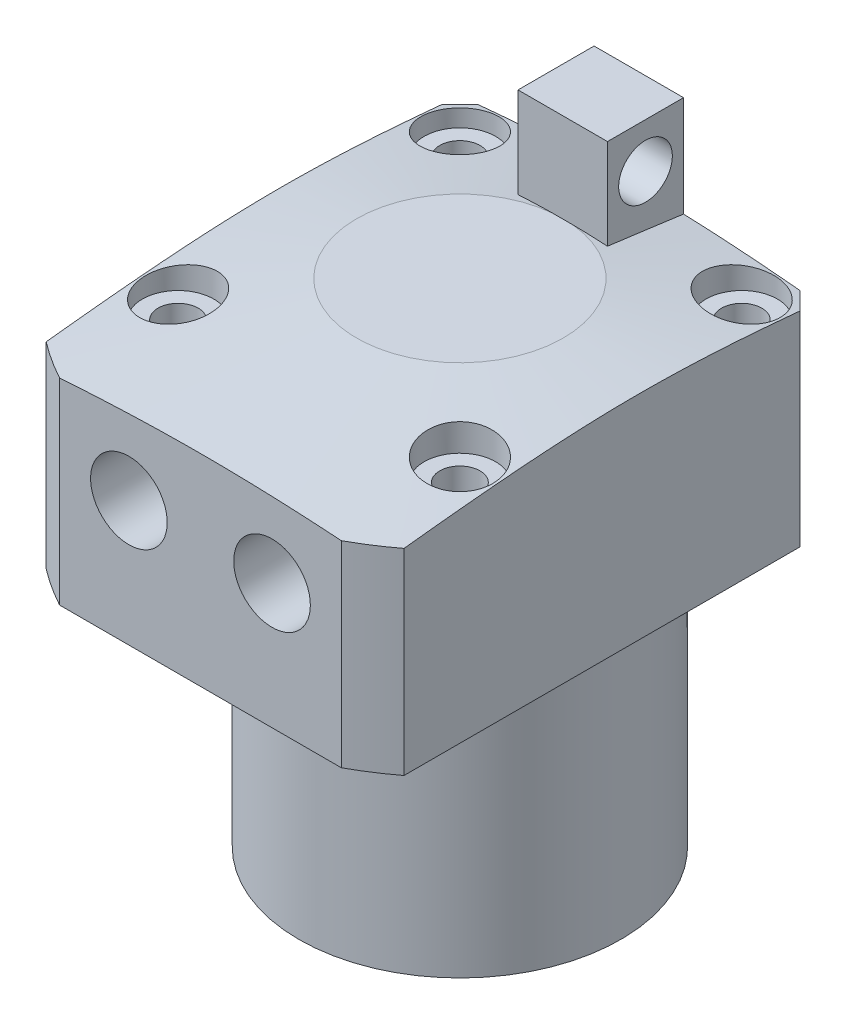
ISO-10303-21;
HEADER;
FILE_DESCRIPTION(('STEP AP214'),'2;1');
FILE_NAME('part.step','',(''),(''),'','','');
FILE_SCHEMA(('AUTOMOTIVE_DESIGN { 1 0 10303 214 1 1 1 1 }'));
ENDSEC;
DATA;
#1=APPLICATION_CONTEXT('core data for automotive mechanical design processes');
#2=APPLICATION_PROTOCOL_DEFINITION('international standard','automotive_design',2000,#1);
#3=PRODUCT_CONTEXT('',#1,'mechanical');
#4=PRODUCT('Part','Part','',(#3));
#5=PRODUCT_RELATED_PRODUCT_CATEGORY('part','',(#4));
#6=PRODUCT_DEFINITION_FORMATION('','',#4);
#7=PRODUCT_DEFINITION_CONTEXT('part definition',#1,'design');
#8=PRODUCT_DEFINITION('design','',#6,#7);
#9=PRODUCT_DEFINITION_SHAPE('','',#8);
#10=(LENGTH_UNIT() NAMED_UNIT(*) SI_UNIT(.MILLI.,.METRE.));
#11=(NAMED_UNIT(*) PLANE_ANGLE_UNIT() SI_UNIT($,.RADIAN.));
#12=(NAMED_UNIT(*) SI_UNIT($,.STERADIAN.) SOLID_ANGLE_UNIT());
#13=UNCERTAINTY_MEASURE_WITH_UNIT(LENGTH_MEASURE(1.E-05),#10,'distance_accuracy_value','');
#14=(GEOMETRIC_REPRESENTATION_CONTEXT(3) GLOBAL_UNCERTAINTY_ASSIGNED_CONTEXT((#13)) GLOBAL_UNIT_ASSIGNED_CONTEXT((#10,
#11,#12)) REPRESENTATION_CONTEXT('',''));
#15=CARTESIAN_POINT('',(0.,0.,0.));
#16=DIRECTION('',(0.,0.,1.));
#17=DIRECTION('',(1.,0.,0.));
#18=AXIS2_PLACEMENT_3D('',#15,#16,#17);
#19=CARTESIAN_POINT('',(-5.,-0.001000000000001,-11.5));
#20=DIRECTION('',(-1.,0.,0.));
#21=DIRECTION('',(0.,0.,1.));
#22=AXIS2_PLACEMENT_3D('',#19,#20,#21);
#23=PLANE('',#22);
#24=CARTESIAN_POINT('',(-5.,55.9211072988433,0.0954930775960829));
#25=CARTESIAN_POINT('',(-5.,55.9217007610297,-0.114536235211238));
#26=CARTESIAN_POINT('',(-5.,55.9203760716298,-0.324567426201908));
#27=CARTESIAN_POINT('',(-5.,55.9140854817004,-0.744561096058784));
#28=CARTESIAN_POINT('',(-5.,55.9091198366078,-0.954523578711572));
#29=CARTESIAN_POINT('',(-5.,55.895746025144,-1.37422483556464));
#30=CARTESIAN_POINT('',(-5.,55.8873396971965,-1.58396366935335));
#31=CARTESIAN_POINT('',(-5.,55.8674399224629,-2.00329672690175));
#32=CARTESIAN_POINT('',(-5.,55.8559464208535,-2.21289094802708));
#33=CARTESIAN_POINT('',(-5.,55.8302821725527,-2.63173074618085));
#34=CARTESIAN_POINT('',(-5.,55.8161137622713,-2.8409764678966));
#35=CARTESIAN_POINT('',(-5.,55.7854967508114,-3.25929890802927));
#36=CARTESIAN_POINT('',(-5.,55.7690481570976,-3.4683756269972));
#37=CARTESIAN_POINT('',(-5.,55.7342399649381,-3.88640293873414));
#38=CARTESIAN_POINT('',(-5.,55.7158800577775,-4.09535350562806));
#39=CARTESIAN_POINT('',(-5.,55.6775756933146,-4.51310839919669));
#40=CARTESIAN_POINT('',(-5.,55.6576312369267,-4.72191272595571));
#41=CARTESIAN_POINT('',(-5.,55.6082363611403,-5.2224824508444));
#42=CARTESIAN_POINT('',(-5.,55.5781622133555,-5.51418616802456));
#43=CARTESIAN_POINT('',(-5.,55.5160526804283,-6.09738540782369));
#44=CARTESIAN_POINT('',(-5.,55.4840172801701,-6.38888092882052));
#45=CARTESIAN_POINT('',(-5.,55.3856644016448,-7.26312783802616));
#46=CARTESIAN_POINT('',(-5.,55.3171016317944,-7.84562599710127));
#47=CARTESIAN_POINT('',(-5.,55.1763264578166,-9.01018554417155));
#48=CARTESIAN_POINT('',(-5.,55.1041139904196,-9.59224692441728));
#49=CARTESIAN_POINT('',(-5.,54.9573178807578,-10.7560611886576));
#50=CARTESIAN_POINT('',(-5.,54.8827342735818,-11.3378140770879));
#51=CARTESIAN_POINT('',(-5.,54.7318734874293,-12.5018485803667));
#52=CARTESIAN_POINT('',(-5.,54.6555942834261,-13.0841299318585));
#53=CARTESIAN_POINT('',(-5.,54.5019064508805,-14.248545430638));
#54=CARTESIAN_POINT('',(-5.,54.4244978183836,-14.8306795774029));
#55=CARTESIAN_POINT('',(-5.,54.1910717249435,-16.5768788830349));
#56=CARTESIAN_POINT('',(-5.,54.0338485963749,-17.7407827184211));
#57=CARTESIAN_POINT('',(-5.,53.7598052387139,-19.7576538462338));
#58=CARTESIAN_POINT('',(-5.,53.6434042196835,-20.6106783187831));
#59=CARTESIAN_POINT('',(-5.,53.4099012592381,-22.3166317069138));
#60=CARTESIAN_POINT('',(-5.,53.2927993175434,-23.1695606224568));
#61=CARTESIAN_POINT('',(-5.,52.9407455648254,-25.7282670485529));
#62=CARTESIAN_POINT('',(-5.,52.7050488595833,-27.433942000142));
#63=CARTESIAN_POINT('',(-5.,52.2330252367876,-30.841626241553));
#64=CARTESIAN_POINT('',(-5.,51.9967006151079,-32.5436358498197));
#65=CARTESIAN_POINT('',(-5.,51.5233165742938,-35.9475276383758));
#66=CARTESIAN_POINT('',(-5.,51.2862571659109,-37.64940982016));
#67=CARTESIAN_POINT('',(-5.,51.0490154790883,-39.3512664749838));
#68=B_SPLINE_CURVE_WITH_KNOTS('',3,(#24,#25,#26,#27,#28,#29,#30,#31,#32,#33,#34,#35,#36,#37,#38,
#39,#40,#41,#42,#43,#44,#45,#46,#47,#48,#49,#50,#51,#52,#53,#54,#55,#56,#57,#58,#59,#60,#61,#62,
#63,#64,#65,#66,#67),.UNSPECIFIED.,.F.,.F.,(4,2,2,2,2,2,2,2,2,2,2,2,2,2,2,2,2,2,2,2,2,4),(0.,
0.630076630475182,1.26010906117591,1.88980529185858,2.51951270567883,3.14867262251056,
3.77783047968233,4.4070901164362,5.03634939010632,5.91608973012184,6.79583685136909,
8.55537202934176,10.3149377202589,12.0744773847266,13.8362452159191,15.5980192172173,
19.1214407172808,21.7042296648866,24.2870196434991,29.4526669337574,34.6076812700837,
39.7626205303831),.UNSPECIFIED.);
#69=CARTESIAN_POINT('',(-5.,54.8615665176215,-11.5));
#70=VERTEX_POINT('',#69);
#71=CARTESIAN_POINT('',(-5.00000000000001,53.7266160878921,-20.));
#72=VERTEX_POINT('',#71);
#73=EDGE_CURVE('E170',#70,#72,#68,.T.);
#74=ORIENTED_EDGE('',*,*,#73,.F.);
#75=DIRECTION('',(0.,1.,0.));
#76=VECTOR('',#75,1.);
#77=CARTESIAN_POINT('',(-5.,-0.001000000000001,-11.5));
#78=LINE('',#77,#76);
#79=CARTESIAN_POINT('',(-5.,65.,-11.5));
#80=VERTEX_POINT('',#79);
#81=EDGE_CURVE('E837',#70,#80,#78,.T.);
#82=ORIENTED_EDGE('',*,*,#81,.T.);
#83=DIRECTION('',(0.,0.,1.));
#84=VECTOR('',#83,1.);
#85=CARTESIAN_POINT('',(-5.,65.,-11.5));
#86=LINE('',#85,#84);
#87=CARTESIAN_POINT('',(-5.,65.,-20.));
#88=VERTEX_POINT('',#87);
#89=EDGE_CURVE('E155',#88,#80,#86,.T.);
#90=ORIENTED_EDGE('',*,*,#89,.F.);
#91=DIRECTION('',(0.,1.,0.));
#92=VECTOR('',#91,1.);
#93=CARTESIAN_POINT('',(-5.,-0.001000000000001,-20.));
#94=LINE('',#93,#92);
#95=EDGE_CURVE('E145',#72,#88,#94,.T.);
#96=ORIENTED_EDGE('',*,*,#95,.F.);
#97=EDGE_LOOP('',(#74,#82,#90,#96));
#98=FACE_BOUND('',#97,.T.);
#99=CARTESIAN_POINT('',(-5.,60.,-15.75));
#100=DIRECTION('',(-1.,0.,0.));
#101=DIRECTION('',(0.,0.,1.));
#102=AXIS2_PLACEMENT_3D('',#99,#100,#101);
#103=CIRCLE('',#102,3.);
#104=CARTESIAN_POINT('',(-5.,60.,-12.75));
#105=VERTEX_POINT('',#104);
#106=EDGE_CURVE('E163',#105,#105,#103,.F.);
#107=ORIENTED_EDGE('',*,*,#106,.T.);
#108=EDGE_LOOP('',(#107));
#109=FACE_BOUND('',#108,.T.);
#110=ADVANCED_FACE('F36',(#98,#109),#23,.T.);
#111=CARTESIAN_POINT('',(-18.,30.,0.));
#112=DIRECTION('',(0.,-1.,0.));
#113=DIRECTION('',(0.,0.,-1.));
#114=AXIS2_PLACEMENT_3D('',#111,#112,#113);
#115=PLANE('',#114);
#116=CARTESIAN_POINT('',(-8.,30.,23.5));
#117=DIRECTION('',(0.,-1.,0.));
#118=DIRECTION('',(0.,0.,-1.));
#119=AXIS2_PLACEMENT_3D('',#116,#117,#118);
#120=CIRCLE('',#119,3.99999999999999);
#121=CARTESIAN_POINT('',(-8.,30.,19.5));
#122=VERTEX_POINT('',#121);
#123=EDGE_CURVE('E834',#122,#122,#120,.T.);
#124=ORIENTED_EDGE('',*,*,#123,.F.);
#125=EDGE_LOOP('',(#124));
#126=FACE_BOUND('',#125,.T.);
#127=CARTESIAN_POINT('',(8.,30.,23.5));
#128=DIRECTION('',(0.,-1.,0.));
#129=DIRECTION('',(0.,0.,-1.));
#130=AXIS2_PLACEMENT_3D('',#127,#128,#129);
#131=CIRCLE('',#130,3.99999999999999);
#132=CARTESIAN_POINT('',(8.,30.,19.5));
#133=VERTEX_POINT('',#132);
#134=EDGE_CURVE('E828',#133,#133,#131,.T.);
#135=ORIENTED_EDGE('',*,*,#134,.F.);
#136=EDGE_LOOP('',(#135));
#137=FACE_BOUND('',#136,.T.);
#138=CARTESIAN_POINT('',(15.75,30.,15.75));
#139=DIRECTION('',(0.,1.,0.));
#140=DIRECTION('',(0.,0.,1.));
#141=AXIS2_PLACEMENT_3D('',#138,#139,#140);
#142=CIRCLE('',#141,2.27499999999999);
#143=CARTESIAN_POINT('',(15.75,30.,18.025));
#144=VERTEX_POINT('',#143);
#145=EDGE_CURVE('E822',#144,#144,#142,.T.);
#146=ORIENTED_EDGE('',*,*,#145,.T.);
#147=EDGE_LOOP('',(#146));
#148=FACE_BOUND('',#147,.T.);
#149=CARTESIAN_POINT('',(-15.75,30.,15.75));
#150=DIRECTION('',(0.,1.,0.));
#151=DIRECTION('',(0.,0.,1.));
#152=AXIS2_PLACEMENT_3D('',#149,#150,#151);
#153=CIRCLE('',#152,2.27499999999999);
#154=CARTESIAN_POINT('',(-15.75,30.,18.025));
#155=VERTEX_POINT('',#154);
#156=EDGE_CURVE('E810',#155,#155,#153,.T.);
#157=ORIENTED_EDGE('',*,*,#156,.T.);
#158=EDGE_LOOP('',(#157));
#159=FACE_BOUND('',#158,.T.);
#160=CARTESIAN_POINT('',(-15.75,30.,-15.75));
#161=DIRECTION('',(0.,1.,0.));
#162=DIRECTION('',(0.,0.,1.));
#163=AXIS2_PLACEMENT_3D('',#160,#161,#162);
#164=CIRCLE('',#163,2.27499999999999);
#165=CARTESIAN_POINT('',(-15.75,30.,-13.475));
#166=VERTEX_POINT('',#165);
#167=EDGE_CURVE('E246',#166,#166,#164,.T.);
#168=ORIENTED_EDGE('',*,*,#167,.T.);
#169=EDGE_LOOP('',(#168));
#170=FACE_BOUND('',#169,.T.);
#171=CARTESIAN_POINT('',(15.75,30.,-15.75));
#172=DIRECTION('',(0.,1.,0.));
#173=DIRECTION('',(0.,0.,1.));
#174=AXIS2_PLACEMENT_3D('',#171,#172,#173);
#175=CIRCLE('',#174,2.27499999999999);
#176=CARTESIAN_POINT('',(15.75,30.,-13.475));
#177=VERTEX_POINT('',#176);
#178=EDGE_CURVE('E760',#177,#177,#175,.T.);
#179=ORIENTED_EDGE('',*,*,#178,.T.);
#180=EDGE_LOOP('',(#179));
#181=FACE_BOUND('',#180,.T.);
#182=CARTESIAN_POINT('',(0.,30.,0.));
#183=DIRECTION('',(0.,1.,0.));
#184=DIRECTION('',(0.,0.,1.));
#185=AXIS2_PLACEMENT_3D('',#182,#183,#184);
#186=CIRCLE('',#185,18.);
#187=CARTESIAN_POINT('',(0.,30.,18.));
#188=VERTEX_POINT('',#187);
#189=EDGE_CURVE('E691',#188,#188,#186,.T.);
#190=ORIENTED_EDGE('',*,*,#189,.T.);
#191=EDGE_LOOP('',(#190));
#192=FACE_BOUND('',#191,.T.);
#193=DIRECTION('',(1.,0.,0.));
#194=VECTOR('',#193,1.);
#195=CARTESIAN_POINT('',(-18.,30.,-20.));
#196=LINE('',#195,#194);
#197=CARTESIAN_POINT('',(-18.,30.,-20.));
#198=VERTEX_POINT('',#197);
#199=CARTESIAN_POINT('',(18.,30.,-20.));
#200=VERTEX_POINT('',#199);
#201=EDGE_CURVE('E723',#198,#200,#196,.T.);
#202=ORIENTED_EDGE('',*,*,#201,.T.);
#203=DIRECTION('',(-0.707106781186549,0.,-0.707106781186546));
#204=VECTOR('',#203,1.);
#205=CARTESIAN_POINT('',(9.99999999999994,30.,-28.));
#206=LINE('',#205,#204);
#207=CARTESIAN_POINT('',(20.,30.,-18.));
#208=VERTEX_POINT('',#207);
#209=EDGE_CURVE('E50',#200,#208,#206,.F.);
#210=ORIENTED_EDGE('',*,*,#209,.T.);
#211=DIRECTION('',(0.,0.,1.));
#212=VECTOR('',#211,1.);
#213=CARTESIAN_POINT('',(20.,30.,0.));
#214=LINE('',#213,#212);
#215=CARTESIAN_POINT('',(20.,30.,26.2488094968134));
#216=VERTEX_POINT('',#215);
#217=EDGE_CURVE('E721',#208,#216,#214,.T.);
#218=ORIENTED_EDGE('',*,*,#217,.T.);
#219=CARTESIAN_POINT('',(0.,30.,0.));
#220=DIRECTION('',(0.,1.,0.));
#221=DIRECTION('',(0.,0.,1.));
#222=AXIS2_PLACEMENT_3D('',#219,#220,#221);
#223=CIRCLE('',#222,33.);
#224=CARTESIAN_POINT('',(15.7480157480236,30.,29.));
#225=VERTEX_POINT('',#224);
#226=EDGE_CURVE('E687',#225,#216,#223,.T.);
#227=ORIENTED_EDGE('',*,*,#226,.F.);
#228=DIRECTION('',(-1.,0.,0.));
#229=VECTOR('',#228,1.);
#230=CARTESIAN_POINT('',(-18.,30.,29.));
#231=LINE('',#230,#229);
#232=CARTESIAN_POINT('',(-15.7480157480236,30.,29.));
#233=VERTEX_POINT('',#232);
#234=EDGE_CURVE('E741',#225,#233,#231,.T.);
#235=ORIENTED_EDGE('',*,*,#234,.T.);
#236=CARTESIAN_POINT('',(-20.,30.,26.2488094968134));
#237=VERTEX_POINT('',#236);
#238=EDGE_CURVE('E678',#237,#233,#223,.T.);
#239=ORIENTED_EDGE('',*,*,#238,.F.);
#240=DIRECTION('',(0.,0.,-1.));
#241=VECTOR('',#240,1.);
#242=CARTESIAN_POINT('',(-20.,30.,0.));
#243=LINE('',#242,#241);
#244=CARTESIAN_POINT('',(-20.,30.,-18.));
#245=VERTEX_POINT('',#244);
#246=EDGE_CURVE('E733',#237,#245,#243,.T.);
#247=ORIENTED_EDGE('',*,*,#246,.T.);
#248=DIRECTION('',(-0.707106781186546,0.,0.707106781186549));
#249=VECTOR('',#248,1.);
#250=CARTESIAN_POINT('',(-28.,30.,-9.99999999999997));
#251=LINE('',#250,#249);
#252=EDGE_CURVE('E715',#245,#198,#251,.F.);
#253=ORIENTED_EDGE('',*,*,#252,.T.);
#254=EDGE_LOOP('',(#202,#210,#218,#227,#235,#239,#247,#253));
#255=FACE_BOUND('',#254,.T.);
#256=ADVANCED_FACE('F371',(#126,#137,#148,#159,#170,#181,#192,#255),#115,.T.);
#257=CARTESIAN_POINT('',(0.,87.0508296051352,0.));
#258=DIRECTION('',(0.,1.,0.));
#259=DIRECTION('',(0.,0.,1.));
#260=AXIS2_PLACEMENT_3D('',#257,#258,#259);
#261=CYLINDRICAL_SURFACE('',#260,33.);
#262=ORIENTED_EDGE('',*,*,#226,.T.);
#263=DIRECTION('',(0.,1.,0.));
#264=VECTOR('',#263,1.);
#265=CARTESIAN_POINT('',(20.,87.0508296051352,26.2488094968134));
#266=LINE('',#265,#264);
#267=CARTESIAN_POINT('',(20.,51.9860920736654,26.2488094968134));
#268=VERTEX_POINT('',#267);
#269=EDGE_CURVE('E726',#216,#268,#266,.T.);
#270=ORIENTED_EDGE('',*,*,#269,.T.);
#271=CARTESIAN_POINT('',(0.,51.9860920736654,0.));
#272=DIRECTION('',(0.,1.,0.));
#273=DIRECTION('',(0.,0.,1.));
#274=AXIS2_PLACEMENT_3D('',#271,#272,#273);
#275=CIRCLE('',#274,33.);
#276=CARTESIAN_POINT('',(15.7480157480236,51.9860920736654,29.));
#277=VERTEX_POINT('',#276);
#278=EDGE_CURVE('E688',#277,#268,#275,.T.);
#279=ORIENTED_EDGE('',*,*,#278,.F.);
#280=DIRECTION('',(0.,1.,0.));
#281=VECTOR('',#280,1.);
#282=CARTESIAN_POINT('',(15.7480157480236,87.0508296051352,29.));
#283=LINE('',#282,#281);
#284=EDGE_CURVE('E735',#277,#225,#283,.F.);
#285=ORIENTED_EDGE('',*,*,#284,.T.);
#286=EDGE_LOOP('',(#262,#270,#279,#285));
#287=FACE_BOUND('',#286,.T.);
#288=ADVANCED_FACE('F262',(#287),#261,.T.);
#289=ORIENTED_EDGE('',*,*,#238,.T.);
#290=DIRECTION('',(0.,1.,0.));
#291=VECTOR('',#290,1.);
#292=CARTESIAN_POINT('',(-15.7480157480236,87.0508296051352,29.));
#293=LINE('',#292,#291);
#294=CARTESIAN_POINT('',(-15.7480157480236,51.9860920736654,29.));
#295=VERTEX_POINT('',#294);
#296=EDGE_CURVE('E680',#233,#295,#293,.T.);
#297=ORIENTED_EDGE('',*,*,#296,.T.);
#298=CARTESIAN_POINT('',(-20.,51.9860920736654,26.2488094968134));
#299=VERTEX_POINT('',#298);
#300=EDGE_CURVE('E693',#299,#295,#275,.T.);
#301=ORIENTED_EDGE('',*,*,#300,.F.);
#302=DIRECTION('',(0.,1.,0.));
#303=VECTOR('',#302,1.);
#304=CARTESIAN_POINT('',(-20.,87.0508296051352,26.2488094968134));
#305=LINE('',#304,#303);
#306=EDGE_CURVE('E683',#299,#237,#305,.F.);
#307=ORIENTED_EDGE('',*,*,#306,.T.);
#308=EDGE_LOOP('',(#289,#297,#301,#307));
#309=FACE_BOUND('',#308,.T.);
#310=ADVANCED_FACE('F259',(#309),#261,.T.);
#311=CARTESIAN_POINT('',(0.,55.,0.));
#312=DIRECTION('',(0.,-1.,0.));
#313=DIRECTION('',(0.,0.,-1.));
#314=AXIS2_PLACEMENT_3D('',#311,#312,#313);
#315=CONICAL_SURFACE('',#314,11.5549307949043,1.43116998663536);
#316=ORIENTED_EDGE('',*,*,#73,.T.);
#317=CARTESIAN_POINT('',(-39.9268987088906,50.3479498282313,-20.));
#318=CARTESIAN_POINT('',(-38.8879590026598,50.478479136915,-20.));
#319=CARTESIAN_POINT('',(-37.8488966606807,50.6080425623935,-20.));
#320=CARTESIAN_POINT('',(-35.7704645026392,50.8647200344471,-20.));
#321=CARTESIAN_POINT('',(-34.7310946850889,50.991834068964,-20.));
#322=CARTESIAN_POINT('',(-32.6520292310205,51.2430897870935,-20.));
#323=CARTESIAN_POINT('',(-31.6123336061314,51.3672315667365,-20.));
#324=CARTESIAN_POINT('',(-29.5325102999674,51.6118414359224,-20.));
#325=CARTESIAN_POINT('',(-28.4923826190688,51.7323095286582,-20.));
#326=CARTESIAN_POINT('',(-26.4130718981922,51.9685024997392,-20.));
#327=CARTESIAN_POINT('',(-25.373889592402,52.0842338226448,-20.));
#328=CARTESIAN_POINT('',(-23.294899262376,52.3099621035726,-20.));
#329=CARTESIAN_POINT('',(-22.255091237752,52.4199590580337,-20.));
#330=CARTESIAN_POINT('',(-20.1745831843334,52.6327175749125,-20.));
#331=CARTESIAN_POINT('',(-19.1338830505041,52.7354781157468,-20.));
#332=CARTESIAN_POINT('',(-17.0516077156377,52.9318028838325,-20.));
#333=CARTESIAN_POINT('',(-16.0100325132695,53.025367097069,-20.));
#334=CARTESIAN_POINT('',(-13.9224664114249,53.2011583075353,-20.));
#335=CARTESIAN_POINT('',(-12.8764722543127,53.2833470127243,-20.));
#336=CARTESIAN_POINT('',(-10.7834241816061,53.4331009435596,-20.));
#337=CARTESIAN_POINT('',(-9.7363702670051,53.5006661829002,-20.));
#338=CARTESIAN_POINT('',(-7.64157722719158,53.6179679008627,-20.));
#339=CARTESIAN_POINT('',(-6.59383842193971,53.6677099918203,-20.));
#340=CARTESIAN_POINT('',(-4.49757370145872,53.7464219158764,-20.));
#341=CARTESIAN_POINT('',(-3.44904779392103,53.7753919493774,-20.));
#342=CARTESIAN_POINT('',(-1.35046601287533,53.8105309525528,-20.));
#343=CARTESIAN_POINT('',(-0.30040971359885,53.8166751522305,-20.));
#344=CARTESIAN_POINT('',(1.79957732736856,53.8056237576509,-20.));
#345=CARTESIAN_POINT('',(2.84950806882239,53.788428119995,-20.));
#346=CARTESIAN_POINT('',(4.9490644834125,53.7319719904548,-20.));
#347=CARTESIAN_POINT('',(5.99868998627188,53.6927052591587,-20.));
#348=CARTESIAN_POINT('',(7.57242100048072,53.6192043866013,-20.));
#349=CARTESIAN_POINT('',(8.09688212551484,53.592270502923,-20.));
#350=CARTESIAN_POINT('',(9.14555543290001,53.5339273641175,-20.));
#351=CARTESIAN_POINT('',(9.66976761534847,53.5025181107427,-20.));
#352=CARTESIAN_POINT('',(11.7062112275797,53.3725597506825,-20.));
#353=CARTESIAN_POINT('',(13.2174980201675,53.2590933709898,-20.));
#354=CARTESIAN_POINT('',(16.2380210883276,53.0073888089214,-20.));
#355=CARTESIAN_POINT('',(17.7472572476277,52.869149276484,-20.));
#356=CARTESIAN_POINT('',(20.7642751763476,52.575057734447,-20.));
#357=CARTESIAN_POINT('',(22.272056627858,52.4192024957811,-20.));
#358=CARTESIAN_POINT('',(25.2862319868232,52.0950042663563,-20.));
#359=CARTESIAN_POINT('',(26.7926259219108,51.9266615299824,-20.));
#360=CARTESIAN_POINT('',(29.8054056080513,51.5808788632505,-20.));
#361=CARTESIAN_POINT('',(31.3117906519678,51.4034328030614,-20.));
#362=CARTESIAN_POINT('',(34.3237735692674,51.0419588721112,-20.));
#363=CARTESIAN_POINT('',(35.8293714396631,50.857930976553,-20.));
#364=CARTESIAN_POINT('',(38.8397933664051,50.4849829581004,-20.));
#365=CARTESIAN_POINT('',(40.3446174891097,50.296063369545,-20.));
#366=CARTESIAN_POINT('',(43.3537887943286,49.9144862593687,-20.));
#367=CARTESIAN_POINT('',(44.8581359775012,49.7218287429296,-20.));
#368=CARTESIAN_POINT('',(47.8636870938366,49.3339753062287,-20.));
#369=CARTESIAN_POINT('',(49.3648917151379,49.1387847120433,-20.));
#370=CARTESIAN_POINT('',(52.3670030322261,48.7461244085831,-20.));
#371=CARTESIAN_POINT('',(53.8679097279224,48.5486546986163,-20.));
#372=CARTESIAN_POINT('',(58.3703714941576,47.9535231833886,-20.));
#373=CARTESIAN_POINT('',(61.3715683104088,47.5531519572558,-20.));
#374=CARTESIAN_POINT('',(67.3689911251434,46.7482111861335,-20.));
#375=CARTESIAN_POINT('',(70.3652180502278,46.3436485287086,-20.));
#376=CARTESIAN_POINT('',(74.8591624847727,45.7343007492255,-20.));
#377=CARTESIAN_POINT('',(76.3570504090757,45.53077129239,-20.));
#378=CARTESIAN_POINT('',(79.352728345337,45.1229951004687,-20.));
#379=CARTESIAN_POINT('',(80.8505183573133,44.918748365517,-20.));
#380=CARTESIAN_POINT('',(82.348267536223,44.7142028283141,-20.));
#381=B_SPLINE_CURVE_WITH_KNOTS('',3,(#317,#318,#319,#320,#321,#322,#323,#324,#325,#326,#327,
#328,#329,#330,#331,#332,#333,#334,#335,#336,#337,#338,#339,#340,#341,#342,#343,#344,#345,#346,
#347,#348,#349,#350,#351,#352,#353,#354,#355,#356,#357,#358,#359,#360,#361,#362,#363,#364,#365,
#366,#367,#368,#369,#370,#371,#372,#373,#374,#375,#376,#377,#378,#379,#380),.UNSPECIFIED.,.F.,
.F.,(4,2,2,2,2,2,2,2,2,2,2,2,2,2,2,2,2,2,2,2,2,2,2,2,2,2,2,2,2,2,2,4),(0.,3.14132323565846,
6.28266193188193,9.4238989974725,12.565133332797,15.7019412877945,18.8387511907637,
21.9760030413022,25.1132596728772,28.2608325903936,31.4084025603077,34.5549805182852,
37.7015281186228,40.8514892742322,44.0014562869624,47.152314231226,48.7277551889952,
50.3031955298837,54.84948362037,59.3960195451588,63.9433902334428,68.4906683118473,
73.0410496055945,77.5914480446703,82.1413515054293,86.6912486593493,91.2327695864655,
95.7742918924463,104.857638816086,113.92788573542,118.462842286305,122.997797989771),.UNSPECIFIED.);
#382=CARTESIAN_POINT('',(-18.,52.8423725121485,-20.));
#383=VERTEX_POINT('',#382);
#384=EDGE_CURVE('E700',#72,#383,#381,.F.);
#385=ORIENTED_EDGE('',*,*,#384,.T.);
#386=CARTESIAN_POINT('',(-18.,52.8423725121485,-20.));
#387=CARTESIAN_POINT('',(-18.3333333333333,52.8458570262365,-19.6666666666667));
#388=CARTESIAN_POINT('',(-18.6666666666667,52.8475992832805,-19.3333333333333));
#389=CARTESIAN_POINT('',(-19.3333333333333,52.8475992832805,-18.6666666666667));
#390=CARTESIAN_POINT('',(-19.6666666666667,52.8458570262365,-18.3333333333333));
#391=CARTESIAN_POINT('',(-20.,52.8423725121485,-18.));
#392=B_SPLINE_CURVE_WITH_KNOTS('',3,(#386,#387,#388,#389,#390,#391),.UNSPECIFIED.,.F.,.F.,(4,2,
4),(0.,1.41422322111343,2.82844644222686),.UNSPECIFIED.);
#393=CARTESIAN_POINT('',(-20.,52.8423725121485,-18.));
#394=VERTEX_POINT('',#393);
#395=EDGE_CURVE('E297',#383,#394,#392,.T.);
#396=ORIENTED_EDGE('',*,*,#395,.T.);
#397=CARTESIAN_POINT('',(-20.,49.9553156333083,-43.0287859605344));
#398=CARTESIAN_POINT('',(-20.,50.0939977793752,-41.9404714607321));
#399=CARTESIAN_POINT('',(-20.,50.2317973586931,-40.8520434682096));
#400=CARTESIAN_POINT('',(-20.,50.5051567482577,-38.6749022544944));
#401=CARTESIAN_POINT('',(-20.,50.6407165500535,-37.5861890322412));
#402=CARTESIAN_POINT('',(-20.,50.9091074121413,-35.4085351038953));
#403=CARTESIAN_POINT('',(-20.,51.0419387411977,-34.3195944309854));
#404=CARTESIAN_POINT('',(-20.,51.3042362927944,-32.141307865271));
#405=CARTESIAN_POINT('',(-20.,51.4337025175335,-31.0519619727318));
#406=CARTESIAN_POINT('',(-20.,51.6882646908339,-28.8742092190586));
#407=CARTESIAN_POINT('',(-20.,51.813366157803,-27.7858030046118));
#408=CARTESIAN_POINT('',(-20.,52.0582797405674,-25.6083930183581));
#409=CARTESIAN_POINT('',(-20.,52.1780918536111,-24.5193892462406));
#410=CARTESIAN_POINT('',(-20.,52.4110055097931,-22.3404616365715));
#411=CARTESIAN_POINT('',(-20.,52.524105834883,-21.2505376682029));
#412=CARTESIAN_POINT('',(-20.,52.7416832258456,-19.0698220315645));
#413=CARTESIAN_POINT('',(-20.,52.8461602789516,-17.9790303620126));
#414=CARTESIAN_POINT('',(-20.,53.0443801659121,-15.7928802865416));
#415=CARTESIAN_POINT('',(-20.,53.138086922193,-14.6975185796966));
#416=CARTESIAN_POINT('',(-20.,53.3113150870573,-12.5056581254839));
#417=CARTESIAN_POINT('',(-20.,53.3908364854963,-11.4091593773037));
#418=CARTESIAN_POINT('',(-20.,53.5321232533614,-9.21540561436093));
#419=CARTESIAN_POINT('',(-20.,53.5938951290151,-8.11815102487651));
#420=CARTESIAN_POINT('',(-20.,53.6960747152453,-5.92262517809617));
#421=CARTESIAN_POINT('',(-20.,53.7364826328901,-4.82435393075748));
#422=CARTESIAN_POINT('',(-20.,53.7789250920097,-3.17582664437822));
#423=CARTESIAN_POINT('',(-20.,53.790045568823,-2.62579539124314));
#424=CARTESIAN_POINT('',(-20.,53.8060045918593,-1.52564306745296));
#425=CARTESIAN_POINT('',(-20.,53.8108431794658,-0.975521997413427));
#426=CARTESIAN_POINT('',(-20.,53.8141312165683,0.124739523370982));
#427=CARTESIAN_POINT('',(-20.,53.8125806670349,0.674879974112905));
#428=CARTESIAN_POINT('',(-20.,53.8031302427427,1.77510336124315));
#429=CARTESIAN_POINT('',(-20.,53.7952303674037,2.32518629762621));
#430=CARTESIAN_POINT('',(-20.,53.7622099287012,3.97559082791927));
#431=CARTESIAN_POINT('',(-20.,53.7277677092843,5.07574046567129));
#432=CARTESIAN_POINT('',(-20.,53.6593902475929,6.72522875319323));
#433=CARTESIAN_POINT('',(-20.,53.6338119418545,7.27493758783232));
#434=CARTESIAN_POINT('',(-20.,53.5775281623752,8.37409283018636));
#435=CARTESIAN_POINT('',(-20.,53.5468227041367,8.92353923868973));
#436=CARTESIAN_POINT('',(-20.,53.4581764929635,10.397098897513));
#437=CARTESIAN_POINT('',(-20.,53.3959516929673,11.3209548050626));
#438=CARTESIAN_POINT('',(-20.,53.260424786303,13.1678558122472));
#439=CARTESIAN_POINT('',(-20.,53.1871225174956,14.0909008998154));
#440=CARTESIAN_POINT('',(-20.,53.0314211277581,15.9362939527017));
#441=CARTESIAN_POINT('',(-20.,52.9490212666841,16.8586418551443));
#442=CARTESIAN_POINT('',(-20.,52.7768312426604,18.7026378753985));
#443=CARTESIAN_POINT('',(-20.,52.6870411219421,19.6242859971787));
#444=CARTESIAN_POINT('',(-20.,52.5014442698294,21.4672465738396));
#445=CARTESIAN_POINT('',(-20.,52.4056357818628,22.3885588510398));
#446=CARTESIAN_POINT('',(-20.,52.2091551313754,24.2306637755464));
#447=CARTESIAN_POINT('',(-20.,52.1084829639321,25.1514564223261));
#448=CARTESIAN_POINT('',(-20.,51.9031807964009,26.9925607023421));
#449=CARTESIAN_POINT('',(-20.,51.7985509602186,27.9128723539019));
#450=CARTESIAN_POINT('',(-20.,51.5860380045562,29.7531204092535));
#451=CARTESIAN_POINT('',(-20.,51.4781548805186,30.6730568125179));
#452=CARTESIAN_POINT('',(-20.,51.1502811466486,33.4342964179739));
#453=CARTESIAN_POINT('',(-20.,50.9262813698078,35.275123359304));
#454=CARTESIAN_POINT('',(-20.,50.4708796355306,38.9558704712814));
#455=CARTESIAN_POINT('',(-20.,50.239477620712,40.795790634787));
#456=CARTESIAN_POINT('',(-20.,49.7713906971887,44.474633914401));
#457=CARTESIAN_POINT('',(-20.,49.5347067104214,46.3135571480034));
#458=CARTESIAN_POINT('',(-20.,49.0574206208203,49.9908894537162));
#459=CARTESIAN_POINT('',(-20.,48.8168185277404,51.8292985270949));
#460=CARTESIAN_POINT('',(-20.,48.3331043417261,55.5023302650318));
#461=CARTESIAN_POINT('',(-20.,48.0899977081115,57.3369536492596));
#462=CARTESIAN_POINT('',(-20.,47.6015069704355,61.005897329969));
#463=CARTESIAN_POINT('',(-20.,47.3561228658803,62.8402176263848));
#464=CARTESIAN_POINT('',(-20.,46.6172890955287,68.3430240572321));
#465=CARTESIAN_POINT('',(-20.,46.121184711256,72.0111536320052));
#466=CARTESIAN_POINT('',(-20.,45.1253930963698,79.3397189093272));
#467=CARTESIAN_POINT('',(-20.,44.6257146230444,83.0001558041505));
#468=CARTESIAN_POINT('',(-20.,43.8738720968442,88.4903850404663));
#469=CARTESIAN_POINT('',(-20.,43.6228777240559,90.3203376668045));
#470=CARTESIAN_POINT('',(-20.,43.1202258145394,93.9801515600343));
#471=CARTESIAN_POINT('',(-20.,42.8685682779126,95.8100128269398));
#472=CARTESIAN_POINT('',(-20.,42.6166373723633,97.6398364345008));
#473=B_SPLINE_CURVE_WITH_KNOTS('',3,(#397,#398,#399,#400,#401,#402,#403,#404,#405,#406,#407,
#408,#409,#410,#411,#412,#413,#414,#415,#416,#417,#418,#419,#420,#421,#422,#423,#424,#425,#426,
#427,#428,#429,#430,#431,#432,#433,#434,#435,#436,#437,#438,#439,#440,#441,#442,#443,#444,#445,
#446,#447,#448,#449,#450,#451,#452,#453,#454,#455,#456,#457,#458,#459,#460,#461,#462,#463,#464,
#465,#466,#467,#468,#469,#470,#471,#472),.UNSPECIFIED.,.F.,.F.,(4,2,2,2,2,2,2,2,2,2,2,2,2,2,2,2,
2,2,2,2,2,2,2,2,2,2,2,2,2,2,2,2,2,2,2,2,2,4),(0.,3.29134598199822,6.58270437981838,
9.87373699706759,13.1647674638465,16.4514740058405,19.7381822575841,23.0254851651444,
26.3127929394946,29.6108097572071,32.9088289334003,36.2056376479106,39.5024144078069,
41.1528148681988,42.8032044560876,44.4535937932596,46.1039832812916,49.405745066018,
51.0566385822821,52.7075271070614,55.4852873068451,58.263088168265,61.0411151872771,
63.8191263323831,66.5979520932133,69.3767806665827,72.1554942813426,74.9342117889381,
80.4974029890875,86.0606373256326,91.6229081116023,97.185165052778,102.737144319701,
108.28912479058,119.39369731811,130.476849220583,136.018105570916,141.559361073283),.UNSPECIFIED.);
#474=EDGE_CURVE('E276',#394,#299,#473,.T.);
#475=ORIENTED_EDGE('',*,*,#474,.T.);
#476=ORIENTED_EDGE('',*,*,#300,.T.);
#477=CARTESIAN_POINT('',(-47.5316231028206,48.7986350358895,29.));
#478=CARTESIAN_POINT('',(-46.1739619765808,48.9614814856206,29.));
#479=CARTESIAN_POINT('',(-44.8160821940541,49.1225328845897,29.));
#480=CARTESIAN_POINT('',(-42.0997789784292,49.4400954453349,29.));
#481=CARTESIAN_POINT('',(-40.7413555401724,49.5966065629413,29.));
#482=CARTESIAN_POINT('',(-38.0236391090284,49.904163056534,29.));
#483=CARTESIAN_POINT('',(-36.6643460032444,50.0552074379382,29.));
#484=CARTESIAN_POINT('',(-33.9450250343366,50.3505279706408,29.));
#485=CARTESIAN_POINT('',(-32.5849971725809,50.4948041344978,29.));
#486=CARTESIAN_POINT('',(-29.8667504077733,50.7747238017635,29.));
#487=CARTESIAN_POINT('',(-28.508533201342,50.9103837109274,29.));
#488=CARTESIAN_POINT('',(-25.7911017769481,51.1713954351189,29.));
#489=CARTESIAN_POINT('',(-24.4318875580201,51.2967472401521,29.));
#490=CARTESIAN_POINT('',(-21.7123168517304,51.5347068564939,29.));
#491=CARTESIAN_POINT('',(-20.3519603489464,51.6473144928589,29.));
#492=CARTESIAN_POINT('',(-17.6300302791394,51.8568861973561,29.));
#493=CARTESIAN_POINT('',(-16.268456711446,51.9538502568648,29.));
#494=CARTESIAN_POINT('',(-13.5398172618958,52.1291573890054,29.));
#495=CARTESIAN_POINT('',(-12.172747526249,52.2074412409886,29.));
#496=CARTESIAN_POINT('',(-9.43750024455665,52.341649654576,29.));
#497=CARTESIAN_POINT('',(-8.06932270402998,52.3975743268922,29.));
#498=CARTESIAN_POINT('',(-5.33239064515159,52.4841627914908,29.));
#499=CARTESIAN_POINT('',(-3.96363626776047,52.5148309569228,29.));
#500=CARTESIAN_POINT('',(-1.22578602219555,52.5491174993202,29.));
#501=CARTESIAN_POINT('',(0.143309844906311,52.5527359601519,29.));
#502=CARTESIAN_POINT('',(2.88272135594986,52.5326883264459,29.));
#503=CARTESIAN_POINT('',(4.25303678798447,52.5089938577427,29.));
#504=CARTESIAN_POINT('',(6.99296882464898,52.4357016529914,29.));
#505=CARTESIAN_POINT('',(8.36258542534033,52.3861037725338,29.));
#506=CARTESIAN_POINT('',(11.1010366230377,52.2636707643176,29.));
#507=CARTESIAN_POINT('',(12.4698710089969,52.190830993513,29.));
#508=CARTESIAN_POINT('',(15.2063167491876,52.025212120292,29.));
#509=CARTESIAN_POINT('',(16.5739281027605,51.9324330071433,29.));
#510=CARTESIAN_POINT('',(19.4522773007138,51.7196126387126,29.));
#511=CARTESIAN_POINT('',(20.9628775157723,51.5977270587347,29.));
#512=CARTESIAN_POINT('',(23.9826932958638,51.3377637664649,29.));
#513=CARTESIAN_POINT('',(25.4919088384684,51.1996857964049,29.));
#514=CARTESIAN_POINT('',(28.5091953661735,50.910725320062,29.));
#515=CARTESIAN_POINT('',(30.0172662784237,50.7598420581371,29.));
#516=CARTESIAN_POINT('',(33.032350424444,50.4479815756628,29.));
#517=CARTESIAN_POINT('',(34.539363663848,50.2870044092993,29.));
#518=CARTESIAN_POINT('',(37.5528315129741,49.957023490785,29.));
#519=CARTESIAN_POINT('',(39.0592859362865,49.7880180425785,29.));
#520=CARTESIAN_POINT('',(42.0714656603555,49.4436350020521,29.));
#521=CARTESIAN_POINT('',(43.5771909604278,49.2682574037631,29.));
#522=CARTESIAN_POINT('',(46.5879821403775,48.9123868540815,29.));
#523=CARTESIAN_POINT('',(48.0930480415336,48.7318940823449,29.));
#524=CARTESIAN_POINT('',(51.1026743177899,48.3667538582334,29.));
#525=CARTESIAN_POINT('',(52.6072346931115,48.1821064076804,29.));
#526=CARTESIAN_POINT('',(55.6116903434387,47.8099360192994,29.));
#527=CARTESIAN_POINT('',(57.1115868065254,47.6224226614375,29.));
#528=CARTESIAN_POINT('',(60.1110271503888,47.2445951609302,29.));
#529=CARTESIAN_POINT('',(61.6105710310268,47.0542810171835,29.));
#530=CARTESIAN_POINT('',(66.1087868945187,46.4798540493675,29.));
#531=CARTESIAN_POINT('',(69.1070142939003,46.0922602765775,29.));
#532=CARTESIAN_POINT('',(75.1006783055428,45.310735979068,29.));
#533=CARTESIAN_POINT('',(78.0961154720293,44.9168096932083,29.));
#534=CARTESIAN_POINT('',(82.5887666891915,44.3222792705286,29.));
#535=CARTESIAN_POINT('',(84.0862221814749,44.1234970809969,29.));
#536=CARTESIAN_POINT('',(87.080991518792,43.7248717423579,29.));
#537=CARTESIAN_POINT('',(88.5783053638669,43.52502859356,29.));
#538=CARTESIAN_POINT('',(90.075558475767,43.3247317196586,29.));
#539=B_SPLINE_CURVE_WITH_KNOTS('',3,(#477,#478,#479,#480,#481,#482,#483,#484,#485,#486,#487,
#488,#489,#490,#491,#492,#493,#494,#495,#496,#497,#498,#499,#500,#501,#502,#503,#504,#505,#506,
#507,#508,#509,#510,#511,#512,#513,#514,#515,#516,#517,#518,#519,#520,#521,#522,#523,#524,#525,
#526,#527,#528,#529,#530,#531,#532,#533,#534,#535,#536,#537,#538),.UNSPECIFIED.,.F.,.F.,(4,2,2,
2,2,2,2,2,2,2,2,2,2,2,2,2,2,2,2,2,2,2,2,2,2,2,2,2,2,2,4),(0.,4.10218177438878,8.20440344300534,
12.3073677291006,16.4103244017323,20.5052189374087,24.6001174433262,28.6950721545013,
32.7900291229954,36.8978005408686,41.0055516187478,45.1125912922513,49.2196182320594,
53.3309156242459,57.442235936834,61.5543780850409,65.666522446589,70.2129391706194,
74.7594282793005,79.3061858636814,83.8529190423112,88.4006170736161,92.94831936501,
97.4958621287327,102.043402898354,106.578116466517,111.112831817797,120.182349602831,
129.246030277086,133.777805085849,138.309578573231),.UNSPECIFIED.);
#540=EDGE_CURVE('E289',#295,#277,#539,.T.);
#541=ORIENTED_EDGE('',*,*,#540,.T.);
#542=ORIENTED_EDGE('',*,*,#278,.T.);
#543=CARTESIAN_POINT('',(20.,49.9553156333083,-43.0287859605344));
#544=CARTESIAN_POINT('',(20.,50.0939977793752,-41.9404714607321));
#545=CARTESIAN_POINT('',(20.,50.2317973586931,-40.8520434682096));
#546=CARTESIAN_POINT('',(20.,50.5051567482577,-38.6749022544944));
#547=CARTESIAN_POINT('',(20.,50.6407165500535,-37.5861890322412));
#548=CARTESIAN_POINT('',(20.,50.9091074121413,-35.4085351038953));
#549=CARTESIAN_POINT('',(20.,51.0419387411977,-34.3195944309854));
#550=CARTESIAN_POINT('',(20.,51.3042362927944,-32.141307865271));
#551=CARTESIAN_POINT('',(20.,51.4337025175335,-31.0519619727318));
#552=CARTESIAN_POINT('',(20.,51.6882646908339,-28.8742092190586));
#553=CARTESIAN_POINT('',(20.,51.813366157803,-27.7858030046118));
#554=CARTESIAN_POINT('',(20.,52.0582797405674,-25.6083930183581));
#555=CARTESIAN_POINT('',(20.,52.1780918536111,-24.5193892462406));
#556=CARTESIAN_POINT('',(20.,52.4110055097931,-22.3404616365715));
#557=CARTESIAN_POINT('',(20.,52.524105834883,-21.2505376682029));
#558=CARTESIAN_POINT('',(20.,52.7416832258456,-19.0698220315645));
#559=CARTESIAN_POINT('',(20.,52.8461602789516,-17.9790303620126));
#560=CARTESIAN_POINT('',(20.,53.0443801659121,-15.7928802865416));
#561=CARTESIAN_POINT('',(20.,53.138086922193,-14.6975185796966));
#562=CARTESIAN_POINT('',(20.,53.3113150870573,-12.5056581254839));
#563=CARTESIAN_POINT('',(20.,53.3908364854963,-11.4091593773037));
#564=CARTESIAN_POINT('',(20.,53.5321232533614,-9.21540561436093));
#565=CARTESIAN_POINT('',(20.,53.5938951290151,-8.11815102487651));
#566=CARTESIAN_POINT('',(20.,53.6960747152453,-5.92262517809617));
#567=CARTESIAN_POINT('',(20.,53.7364826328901,-4.82435393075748));
#568=CARTESIAN_POINT('',(20.,53.7789250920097,-3.17582664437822));
#569=CARTESIAN_POINT('',(20.,53.790045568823,-2.62579539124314));
#570=CARTESIAN_POINT('',(20.,53.8060045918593,-1.52564306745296));
#571=CARTESIAN_POINT('',(20.,53.8108431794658,-0.975521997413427));
#572=CARTESIAN_POINT('',(20.,53.8141312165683,0.124739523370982));
#573=CARTESIAN_POINT('',(20.,53.8125806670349,0.674879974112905));
#574=CARTESIAN_POINT('',(20.,53.8031302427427,1.77510336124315));
#575=CARTESIAN_POINT('',(20.,53.7952303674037,2.32518629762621));
#576=CARTESIAN_POINT('',(20.,53.7622099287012,3.97559082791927));
#577=CARTESIAN_POINT('',(20.,53.7277677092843,5.07574046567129));
#578=CARTESIAN_POINT('',(20.,53.6593902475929,6.72522875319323));
#579=CARTESIAN_POINT('',(20.,53.6338119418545,7.27493758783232));
#580=CARTESIAN_POINT('',(20.,53.5775281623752,8.37409283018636));
#581=CARTESIAN_POINT('',(20.,53.5468227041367,8.92353923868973));
#582=CARTESIAN_POINT('',(20.,53.4581764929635,10.397098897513));
#583=CARTESIAN_POINT('',(20.,53.3959516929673,11.3209548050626));
#584=CARTESIAN_POINT('',(20.,53.260424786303,13.1678558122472));
#585=CARTESIAN_POINT('',(20.,53.1871225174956,14.0909008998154));
#586=CARTESIAN_POINT('',(20.,53.0314211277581,15.9362939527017));
#587=CARTESIAN_POINT('',(20.,52.9490212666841,16.8586418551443));
#588=CARTESIAN_POINT('',(20.,52.7768312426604,18.7026378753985));
#589=CARTESIAN_POINT('',(20.,52.6870411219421,19.6242859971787));
#590=CARTESIAN_POINT('',(20.,52.5014442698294,21.4672465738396));
#591=CARTESIAN_POINT('',(20.,52.4056357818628,22.3885588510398));
#592=CARTESIAN_POINT('',(20.,52.2091551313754,24.2306637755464));
#593=CARTESIAN_POINT('',(20.,52.1084829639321,25.1514564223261));
#594=CARTESIAN_POINT('',(20.,51.9031807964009,26.9925607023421));
#595=CARTESIAN_POINT('',(20.,51.7985509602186,27.9128723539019));
#596=CARTESIAN_POINT('',(20.,51.5860380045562,29.7531204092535));
#597=CARTESIAN_POINT('',(20.,51.4781548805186,30.6730568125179));
#598=CARTESIAN_POINT('',(20.,51.1502811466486,33.4342964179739));
#599=CARTESIAN_POINT('',(20.,50.9262813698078,35.275123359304));
#600=CARTESIAN_POINT('',(20.,50.4708796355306,38.9558704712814));
#601=CARTESIAN_POINT('',(20.,50.239477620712,40.795790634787));
#602=CARTESIAN_POINT('',(20.,49.7713906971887,44.474633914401));
#603=CARTESIAN_POINT('',(20.,49.5347067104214,46.3135571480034));
#604=CARTESIAN_POINT('',(20.,49.0574206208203,49.9908894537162));
#605=CARTESIAN_POINT('',(20.,48.8168185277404,51.8292985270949));
#606=CARTESIAN_POINT('',(20.,48.3331043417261,55.5023302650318));
#607=CARTESIAN_POINT('',(20.,48.0899977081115,57.3369536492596));
#608=CARTESIAN_POINT('',(20.,47.6015069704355,61.005897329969));
#609=CARTESIAN_POINT('',(20.,47.3561228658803,62.8402176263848));
#610=CARTESIAN_POINT('',(20.,46.6172890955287,68.3430240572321));
#611=CARTESIAN_POINT('',(20.,46.121184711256,72.0111536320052));
#612=CARTESIAN_POINT('',(20.,45.1253930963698,79.3397189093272));
#613=CARTESIAN_POINT('',(20.,44.6257146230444,83.0001558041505));
#614=CARTESIAN_POINT('',(20.,43.8738720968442,88.4903850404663));
#615=CARTESIAN_POINT('',(20.,43.6228777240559,90.3203376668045));
#616=CARTESIAN_POINT('',(20.,43.1202258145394,93.9801515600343));
#617=CARTESIAN_POINT('',(20.,42.8685682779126,95.8100128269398));
#618=CARTESIAN_POINT('',(20.,42.6166373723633,97.6398364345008));
#619=B_SPLINE_CURVE_WITH_KNOTS('',3,(#543,#544,#545,#546,#547,#548,#549,#550,#551,#552,#553,
#554,#555,#556,#557,#558,#559,#560,#561,#562,#563,#564,#565,#566,#567,#568,#569,#570,#571,#572,
#573,#574,#575,#576,#577,#578,#579,#580,#581,#582,#583,#584,#585,#586,#587,#588,#589,#590,#591,
#592,#593,#594,#595,#596,#597,#598,#599,#600,#601,#602,#603,#604,#605,#606,#607,#608,#609,#610,
#611,#612,#613,#614,#615,#616,#617,#618),.UNSPECIFIED.,.F.,.F.,(4,2,2,2,2,2,2,2,2,2,2,2,2,2,2,2,
2,2,2,2,2,2,2,2,2,2,2,2,2,2,2,2,2,2,2,2,2,4),(0.,3.29134598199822,6.58270437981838,
9.87373699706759,13.1647674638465,16.4514740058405,19.7381822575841,23.0254851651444,
26.3127929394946,29.6108097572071,32.9088289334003,36.2056376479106,39.5024144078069,
41.1528148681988,42.8032044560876,44.4535937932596,46.1039832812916,49.405745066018,
51.0566385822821,52.7075271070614,55.4852873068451,58.263088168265,61.0411151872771,
63.8191263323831,66.5979520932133,69.3767806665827,72.1554942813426,74.9342117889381,
80.4974029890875,86.0606373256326,91.6229081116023,97.185165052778,102.737144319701,
108.28912479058,119.39369731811,130.476849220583,136.018105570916,141.559361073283),.UNSPECIFIED.);
#620=CARTESIAN_POINT('',(20.,52.8423725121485,-18.));
#621=VERTEX_POINT('',#620);
#622=EDGE_CURVE('E283',#268,#621,#619,.F.);
#623=ORIENTED_EDGE('',*,*,#622,.T.);
#624=CARTESIAN_POINT('',(20.,52.8423725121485,-18.));
#625=CARTESIAN_POINT('',(19.6666666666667,52.8458570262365,-18.3333333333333));
#626=CARTESIAN_POINT('',(19.3333333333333,52.8475992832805,-18.6666666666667));
#627=CARTESIAN_POINT('',(18.6666666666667,52.8475992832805,-19.3333333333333));
#628=CARTESIAN_POINT('',(18.3333333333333,52.8458570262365,-19.6666666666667));
#629=CARTESIAN_POINT('',(18.,52.8423725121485,-20.));
#630=B_SPLINE_CURVE_WITH_KNOTS('',3,(#624,#625,#626,#627,#628,#629),.UNSPECIFIED.,.F.,.F.,(4,2,
4),(0.,1.41422322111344,2.82844644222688),.UNSPECIFIED.);
#631=CARTESIAN_POINT('',(17.9999999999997,52.8423725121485,-20.));
#632=VERTEX_POINT('',#631);
#633=EDGE_CURVE('E303',#621,#632,#630,.T.);
#634=ORIENTED_EDGE('',*,*,#633,.T.);
#635=CARTESIAN_POINT('',(5.00000000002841,53.7266160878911,-20.));
#636=VERTEX_POINT('',#635);
#637=EDGE_CURVE('E267',#632,#636,#381,.F.);
#638=ORIENTED_EDGE('',*,*,#637,.T.);
#639=CARTESIAN_POINT('',(5.,51.0490154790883,-39.3512664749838));
#640=CARTESIAN_POINT('',(4.99999999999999,51.2865372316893,-37.6473633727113));
#641=CARTESIAN_POINT('',(5.,51.5238839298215,-35.9434356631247));
#642=CARTESIAN_POINT('',(5.,51.9978163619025,-32.5356249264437));
#643=CARTESIAN_POINT('',(5.,52.2344021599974,-30.8317419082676));
#644=CARTESIAN_POINT('',(5.,52.5884049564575,-28.2760020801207));
#645=CARTESIAN_POINT('',(5.,52.7062459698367,-27.4242040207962));
#646=CARTESIAN_POINT('',(5.,52.9415497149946,-25.7205574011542));
#647=CARTESIAN_POINT('',(5.,53.059012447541,-24.8687088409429));
#648=CARTESIAN_POINT('',(5.,53.2934445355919,-23.1648725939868));
#649=CARTESIAN_POINT('',(5.,53.4104138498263,-22.3128849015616));
#650=CARTESIAN_POINT('',(5.,53.6436604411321,-20.6088082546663));
#651=CARTESIAN_POINT('',(5.,53.7599377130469,-19.7567192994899));
#652=CARTESIAN_POINT('',(5.,53.9829222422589,-18.1155469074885));
#653=CARTESIAN_POINT('',(5.,54.089700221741,-17.3264730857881));
#654=CARTESIAN_POINT('',(5.,54.3020249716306,-15.7481805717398));
#655=CARTESIAN_POINT('',(5.,54.4075717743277,-14.9589618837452));
#656=CARTESIAN_POINT('',(5.,54.6167725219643,-13.380471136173));
#657=CARTESIAN_POINT('',(5.,54.720426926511,-12.5911991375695));
#658=CARTESIAN_POINT('',(5.,54.9247788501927,-11.0121923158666));
#659=CARTESIAN_POINT('',(5.,55.0254760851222,-10.2224574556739));
#660=CARTESIAN_POINT('',(5.,55.1726599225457,-9.03703087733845));
#661=CARTESIAN_POINT('',(5.,55.2210974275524,-8.64158194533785));
#662=CARTESIAN_POINT('',(5.,55.3161730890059,-7.85046831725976));
#663=CARTESIAN_POINT('',(5.,55.3628112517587,-7.45480362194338));
#664=CARTESIAN_POINT('',(5.,55.453586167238,-6.66330064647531));
#665=CARTESIAN_POINT('',(5.,55.4977236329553,-6.26746244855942));
#666=CARTESIAN_POINT('',(5.,55.5824775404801,-5.47538893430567));
#667=CARTESIAN_POINT('',(5.,55.6230938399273,-5.07915360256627));
#668=CARTESIAN_POINT('',(5.,55.6993152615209,-4.28577217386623));
#669=CARTESIAN_POINT('',(5.,55.7349150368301,-3.88862555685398));
#670=CARTESIAN_POINT('',(5.,55.7988618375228,-3.09377594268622));
#671=CARTESIAN_POINT('',(5.,55.827209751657,-2.69607301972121));
#672=CARTESIAN_POINT('',(5.,55.862257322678,-2.09888076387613));
#673=CARTESIAN_POINT('',(5.,55.8726974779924,-1.89961055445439));
#674=CARTESIAN_POINT('',(5.,55.8907367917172,-1.50094248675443));
#675=CARTESIAN_POINT('',(5.,55.8983359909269,-1.30154463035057));
#676=CARTESIAN_POINT('',(5.,55.91040156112,-0.902568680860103));
#677=CARTESIAN_POINT('',(5.,55.9148666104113,-0.702990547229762));
#678=CARTESIAN_POINT('',(5.,55.920499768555,-0.303776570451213));
#679=CARTESIAN_POINT('',(5.,55.9216676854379,-0.10414072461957));
#680=CARTESIAN_POINT('',(5.,55.9211072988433,0.0954930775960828));
#681=B_SPLINE_CURVE_WITH_KNOTS('',3,(#639,#640,#641,#642,#643,#644,#645,#646,#647,#648,#649,
#650,#651,#652,#653,#654,#655,#656,#657,#658,#659,#660,#661,#662,#663,#664,#665,#666,#667,#668,
#669,#670,#671,#672,#673,#674,#675,#676,#677,#678,#679,#680),.UNSPECIFIED.,.F.,.F.,(4,2,2,2,2,2,
2,2,2,2,2,2,2,2,2,2,2,2,2,2,4),(0.,5.16113598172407,10.3218248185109,12.901556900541,
15.4812837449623,18.0612222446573,20.6411799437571,23.0299764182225,25.4187101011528,
27.8068556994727,30.1952300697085,31.3904403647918,32.5856464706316,33.7805100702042,
34.9754219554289,36.1715979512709,37.3676272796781,37.9662409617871,38.5648460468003,
39.1637034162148,39.762595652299),.UNSPECIFIED.);
#682=CARTESIAN_POINT('',(5.,54.8615665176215,-11.5));
#683=VERTEX_POINT('',#682);
#684=EDGE_CURVE('E65',#636,#683,#681,.T.);
#685=ORIENTED_EDGE('',*,*,#684,.T.);
#686=CARTESIAN_POINT('',(12.3431501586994,54.2529888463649,-11.5));
#687=CARTESIAN_POINT('',(11.9900154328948,54.2892966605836,-11.5));
#688=CARTESIAN_POINT('',(11.6368079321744,54.3248965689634,-11.5));
#689=CARTESIAN_POINT('',(10.930226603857,54.394445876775,-11.5));
#690=CARTESIAN_POINT('',(10.5768527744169,54.4283952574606,-11.5));
#691=CARTESIAN_POINT('',(9.51635330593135,54.5274245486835,-11.5));
#692=CARTESIAN_POINT('',(8.80895892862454,54.5896742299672,-11.5));
#693=CARTESIAN_POINT('',(7.39295579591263,54.7042789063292,-11.5));
#694=CARTESIAN_POINT('',(6.68434658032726,54.7566282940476,-11.5));
#695=CARTESIAN_POINT('',(5.26631254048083,54.8485088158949,-11.5));
#696=CARTESIAN_POINT('',(4.55688775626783,54.8880405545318,-11.5));
#697=CARTESIAN_POINT('',(3.14059519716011,54.951176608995,-11.5));
#698=CARTESIAN_POINT('',(2.43373075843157,54.97485369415,-11.5));
#699=CARTESIAN_POINT('',(1.01962106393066,55.0043537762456,-11.5));
#700=CARTESIAN_POINT('',(0.312375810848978,55.0101768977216,-11.5));
#701=CARTESIAN_POINT('',(-1.10176975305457,55.0033598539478,-11.5));
#702=CARTESIAN_POINT('',(-1.80867009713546,54.9907262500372,-11.5));
#703=CARTESIAN_POINT('',(-3.22194790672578,54.9482978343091,-11.5));
#704=CARTESIAN_POINT('',(-3.92832536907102,54.9185029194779,-11.5));
#705=CARTESIAN_POINT('',(-4.9557993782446,54.8645351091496,-11.5));
#706=CARTESIAN_POINT('',(-5.27721453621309,54.8461374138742,-11.5));
#707=CARTESIAN_POINT('',(-5.91986974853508,54.8066020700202,-11.5));
#708=CARTESIAN_POINT('',(-6.24110980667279,54.7854644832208,-11.5));
#709=CARTESIAN_POINT('',(-7.20462823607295,54.7183539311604,-11.5));
#710=CARTESIAN_POINT('',(-7.84664973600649,54.6686861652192,-11.5));
#711=CARTESIAN_POINT('',(-9.13148023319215,54.5614531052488,-11.5));
#712=CARTESIAN_POINT('',(-9.77428774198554,54.5038702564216,-11.5));
#713=CARTESIAN_POINT('',(-10.7380004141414,54.4129406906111,-11.5));
#714=CARTESIAN_POINT('',(-11.0591233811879,54.3818748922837,-11.5));
#715=CARTESIAN_POINT('',(-11.7012344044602,54.3183976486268,-11.5));
#716=CARTESIAN_POINT('',(-12.0222224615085,54.2859862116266,-11.5));
#717=CARTESIAN_POINT('',(-12.3431501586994,54.2529888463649,-11.5));
#718=B_SPLINE_CURVE_WITH_KNOTS('',3,(#686,#687,#688,#689,#690,#691,#692,#693,#694,#695,#696,
#697,#698,#699,#700,#701,#702,#703,#704,#705,#706,#707,#708,#709,#710,#711,#712,#713,#714,#715,
#716,#717),.UNSPECIFIED.,.F.,.F.,(4,2,2,2,2,2,2,2,2,2,2,2,2,2,2,4),(0.,1.0649876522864,
2.1299873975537,4.2603163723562,6.39184833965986,8.52327976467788,10.6448600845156,
12.7664256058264,14.8872370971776,17.0080613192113,17.9738765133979,18.9396699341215,
20.8714223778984,22.8075305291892,23.7753946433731,24.7432527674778),.UNSPECIFIED.);
#719=CARTESIAN_POINT('',(1.12535579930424,55.,-11.5));
#720=VERTEX_POINT('',#719);
#721=EDGE_CURVE('E195',#683,#720,#718,.T.);
#722=ORIENTED_EDGE('',*,*,#721,.T.);
#723=CARTESIAN_POINT('',(0.,55.,0.));
#724=DIRECTION('',(0.,1.,0.));
#725=DIRECTION('',(0.,0.,1.));
#726=AXIS2_PLACEMENT_3D('',#723,#724,#725);
#727=CIRCLE('',#726,11.5549307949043);
#728=CARTESIAN_POINT('',(-1.12535579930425,55.,-11.5));
#729=VERTEX_POINT('',#728);
#730=EDGE_CURVE('E727',#729,#720,#727,.T.);
#731=ORIENTED_EDGE('',*,*,#730,.F.);
#732=EDGE_CURVE('E58',#729,#70,#718,.T.);
#733=ORIENTED_EDGE('',*,*,#732,.T.);
#734=EDGE_LOOP('',(#316,#385,#396,#475,#476,#541,#542,#623,#634,#638,#685,#722,#731,#733));
#735=FACE_BOUND('',#734,.T.);
#736=CARTESIAN_POINT('',(12.9215728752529,54.0557155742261,12.9215728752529));
#737=CARTESIAN_POINT('',(12.7642830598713,54.0557130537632,13.0788772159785));
#738=CARTESIAN_POINT('',(12.6200330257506,54.0525191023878,13.2494505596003));
#739=CARTESIAN_POINT('',(12.361868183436,54.0398995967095,13.612188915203));
#740=CARTESIAN_POINT('',(12.2479901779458,54.0304665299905,13.8043797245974));
#741=CARTESIAN_POINT('',(12.0539239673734,54.0058612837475,14.2045516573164));
#742=CARTESIAN_POINT('',(11.9737078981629,53.9906938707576,14.412519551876));
#743=CARTESIAN_POINT('',(11.8489411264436,53.9553562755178,14.8384179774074));
#744=CARTESIAN_POINT('',(11.8043829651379,53.9351871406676,15.0563464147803));
#745=CARTESIAN_POINT('',(11.7517349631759,53.8905777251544,15.4977465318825));
#746=CARTESIAN_POINT('',(11.7439114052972,53.8661075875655,15.7212469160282));
#747=CARTESIAN_POINT('',(11.7654703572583,53.8139905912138,16.1660774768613));
#748=CARTESIAN_POINT('',(11.7948565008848,53.7863434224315,16.3874074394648));
#749=CARTESIAN_POINT('',(11.8904712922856,53.7285188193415,16.8245814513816));
#750=CARTESIAN_POINT('',(11.9571574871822,53.6983139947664,17.0403218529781));
#751=CARTESIAN_POINT('',(12.1257232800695,53.6366897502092,17.4574009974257));
#752=CARTESIAN_POINT('',(12.2276046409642,53.6052702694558,17.6587390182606));
#753=CARTESIAN_POINT('',(12.464668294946,53.5418988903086,18.0430291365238));
#754=CARTESIAN_POINT('',(12.6001199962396,53.5099447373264,18.2258147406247));
#755=CARTESIAN_POINT('',(12.9000614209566,53.4466494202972,18.5658935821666));
#756=CARTESIAN_POINT('',(13.0645515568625,53.4153082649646,18.7231864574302));
#757=CARTESIAN_POINT('',(13.418197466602,53.3539960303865,19.0079605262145));
#758=CARTESIAN_POINT('',(13.6073872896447,53.3240269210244,19.1353998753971));
#759=CARTESIAN_POINT('',(14.0049023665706,53.2662212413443,19.3564316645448));
#760=CARTESIAN_POINT('',(14.2132273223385,53.2383846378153,19.4500246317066));
#761=CARTESIAN_POINT('',(14.6421233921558,53.1855879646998,19.6001959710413));
#762=CARTESIAN_POINT('',(14.8626367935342,53.1606158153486,19.6569348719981));
#763=CARTESIAN_POINT('',(15.3104266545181,53.1139426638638,19.7322500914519));
#764=CARTESIAN_POINT('',(15.5377028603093,53.0922415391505,19.7508278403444));
#765=CARTESIAN_POINT('',(15.9907574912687,53.0527063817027,19.7491217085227));
#766=CARTESIAN_POINT('',(16.2165346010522,53.0348450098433,19.7291234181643));
#767=CARTESIAN_POINT('',(16.6617524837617,53.0031445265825,19.6512525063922));
#768=CARTESIAN_POINT('',(16.8811935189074,52.9893052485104,19.5933814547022));
#769=CARTESIAN_POINT('',(17.3057682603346,52.9660072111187,19.4418849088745));
#770=CARTESIAN_POINT('',(17.5109960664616,52.9565167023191,19.3485279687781));
#771=CARTESIAN_POINT('',(17.9029966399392,52.9419473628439,19.1286248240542));
#772=CARTESIAN_POINT('',(18.0897700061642,52.9368683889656,19.0020796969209));
#773=CARTESIAN_POINT('',(18.4385677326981,52.9312330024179,18.7201241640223));
#774=CARTESIAN_POINT('',(18.600714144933,52.9306535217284,18.5648651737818));
#775=CARTESIAN_POINT('',(18.8967801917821,52.9339671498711,18.2294772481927));
#776=CARTESIAN_POINT('',(19.0307002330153,52.9378601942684,18.0493486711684));
#777=CARTESIAN_POINT('',(19.2663640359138,52.9500366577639,17.6696461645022));
#778=CARTESIAN_POINT('',(19.3681538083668,52.9583137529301,17.4701005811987));
#779=CARTESIAN_POINT('',(19.5370110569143,52.9790981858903,17.0570322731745));
#780=CARTESIAN_POINT('',(19.6040783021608,52.9916055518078,16.8435094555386));
#781=CARTESIAN_POINT('',(19.7018362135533,53.0206503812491,16.4079753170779));
#782=CARTESIAN_POINT('',(19.7324318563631,53.0371982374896,16.1859433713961));
#783=CARTESIAN_POINT('',(19.7562106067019,53.0739861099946,15.7401922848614));
#784=CARTESIAN_POINT('',(19.7493927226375,53.0942262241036,15.5164730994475));
#785=CARTESIAN_POINT('',(19.6985409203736,53.1381283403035,15.0722900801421));
#786=CARTESIAN_POINT('',(19.6542861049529,53.1618099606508,14.8518534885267));
#787=CARTESIAN_POINT('',(19.5296757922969,53.2120157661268,14.4217751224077));
#788=CARTESIAN_POINT('',(19.4493189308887,53.2385400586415,14.2121337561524));
#789=CARTESIAN_POINT('',(19.2541449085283,53.2940739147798,13.8079076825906));
#790=CARTESIAN_POINT('',(19.1390695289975,53.323100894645,13.6134500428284));
#791=CARTESIAN_POINT('',(18.8780333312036,53.3827985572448,13.2467902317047));
#792=CARTESIAN_POINT('',(18.7320711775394,53.4134693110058,13.0745890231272));
#793=CARTESIAN_POINT('',(18.4123141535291,53.4759184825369,12.756115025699));
#794=CARTESIAN_POINT('',(18.2383351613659,53.5077030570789,12.6100282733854));
#795=CARTESIAN_POINT('',(17.8682031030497,53.5713261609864,12.3493444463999));
#796=CARTESIAN_POINT('',(17.6720493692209,53.603164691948,12.2347483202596));
#797=CARTESIAN_POINT('',(17.2624274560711,53.666059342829,12.0399925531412));
#798=CARTESIAN_POINT('',(17.0489061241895,53.6971126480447,11.9599437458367));
#799=CARTESIAN_POINT('',(16.6111318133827,53.7573101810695,11.8371843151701));
#800=CARTESIAN_POINT('',(16.3868792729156,53.7864544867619,11.7944721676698));
#801=CARTESIAN_POINT('',(15.9347478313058,53.8416755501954,11.7478315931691));
#802=CARTESIAN_POINT('',(15.7068831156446,53.8677619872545,11.7437773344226));
#803=CARTESIAN_POINT('',(15.2532805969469,53.9159172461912,11.7744573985));
#804=CARTESIAN_POINT('',(15.0275432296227,53.9379852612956,11.8091995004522));
#805=CARTESIAN_POINT('',(14.5869659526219,53.9769069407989,11.9161668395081));
#806=CARTESIAN_POINT('',(14.3720429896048,53.9938080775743,11.9880334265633));
#807=CARTESIAN_POINT('',(13.9572786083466,54.0218323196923,12.167118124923));
#808=CARTESIAN_POINT('',(13.7574177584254,54.0329629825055,12.2742896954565));
#809=CARTESIAN_POINT('',(13.4516187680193,54.0458258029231,12.4732938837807));
#810=CARTESIAN_POINT('',(13.3391423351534,54.0495265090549,12.5551492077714));
#811=CARTESIAN_POINT('',(13.123270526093,54.0544721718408,12.7301331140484));
#812=CARTESIAN_POINT('',(13.0198750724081,54.0557171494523,12.8232616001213));
#813=CARTESIAN_POINT('',(12.9215728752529,54.0557155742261,12.9215728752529));
#814=B_SPLINE_CURVE_WITH_KNOTS('',3,(#736,#737,#738,#739,#740,#741,#742,#743,#744,#745,#746,
#747,#748,#749,#750,#751,#752,#753,#754,#755,#756,#757,#758,#759,#760,#761,#762,#763,#764,#765,
#766,#767,#768,#769,#770,#771,#772,#773,#774,#775,#776,#777,#778,#779,#780,#781,#782,#783,#784,
#785,#786,#787,#788,#789,#790,#791,#792,#793,#794,#795,#796,#797,#798,#799,#800,#801,#802,#803,
#804,#805,#806,#807,#808,#809,#810,#811,#812,#813),.UNSPECIFIED.,.T.,.F.,(4,2,2,2,2,2,2,2,2,2,2,
2,2,2,2,2,2,2,2,2,2,2,2,2,2,2,2,2,2,2,2,2,2,2,2,2,2,2,4),(0.,0.666843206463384,1.33449081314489,
2.00158467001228,2.66853895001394,3.34032047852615,4.01216761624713,4.69244275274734,
5.37275196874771,6.05870837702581,6.74467452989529,7.43159649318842,8.11850775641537,
8.80240654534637,9.48627969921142,10.1651093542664,10.8439108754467,11.5176743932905,
12.191416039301,12.8617012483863,13.5319768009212,14.2012881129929,14.8706038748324,
15.5416596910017,16.2127332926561,16.8877944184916,17.5628810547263,18.2431178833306,
18.9233841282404,19.6083185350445,20.2932735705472,20.9804100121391,21.6675184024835,
22.3523894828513,23.0373979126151,23.7159090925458,24.3935293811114,24.8102932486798,
25.2270535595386),.UNSPECIFIED.);
#815=CARTESIAN_POINT('',(12.9215728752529,54.0557155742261,12.9215728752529));
#816=VERTEX_POINT('',#815);
#817=EDGE_CURVE('E41',#816,#816,#814,.T.);
#818=ORIENTED_EDGE('',*,*,#817,.F.);
#819=EDGE_LOOP('',(#818));
#820=FACE_BOUND('',#819,.T.);
#821=CARTESIAN_POINT('',(-18.524676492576,53.4539094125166,12.8688248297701));
#822=CARTESIAN_POINT('',(-18.6873854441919,53.4225640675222,13.0255329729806));
#823=CARTESIAN_POINT('',(-18.8369471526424,53.3916066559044,13.1962058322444));
#824=CARTESIAN_POINT('',(-19.1053283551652,53.3312604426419,13.5606848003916));
#825=CARTESIAN_POINT('',(-19.2241117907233,53.3018735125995,13.7545176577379));
#826=CARTESIAN_POINT('',(-19.4272768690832,53.2453834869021,14.1597271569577));
#827=CARTESIAN_POINT('',(-19.5116658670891,53.2182799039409,14.3711000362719));
#828=CARTESIAN_POINT('',(-19.6434711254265,53.1669599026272,14.8053514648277));
#829=CARTESIAN_POINT('',(-19.6908970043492,53.1427427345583,15.0282270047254));
#830=CARTESIAN_POINT('',(-19.7471437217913,53.097810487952,15.4780372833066));
#831=CARTESIAN_POINT('',(-19.7561509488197,53.0770789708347,15.7049470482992));
#832=CARTESIAN_POINT('',(-19.7356413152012,53.0393985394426,16.1573462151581));
#833=CARTESIAN_POINT('',(-19.7061244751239,53.0224496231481,16.3828356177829));
#834=CARTESIAN_POINT('',(-19.6096505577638,52.9927888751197,16.8241100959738));
#835=CARTESIAN_POINT('',(-19.5429848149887,52.9800452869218,17.039956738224));
#836=CARTESIAN_POINT('',(-19.3742221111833,52.9588634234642,17.4575491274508));
#837=CARTESIAN_POINT('',(-19.2721265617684,52.9504249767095,17.6592954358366));
#838=CARTESIAN_POINT('',(-19.0361136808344,52.9380537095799,18.0416409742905));
#839=CARTESIAN_POINT('',(-18.9023979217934,52.9340932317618,18.2223637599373));
#840=CARTESIAN_POINT('',(-18.6065988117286,52.9306585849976,18.5589200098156));
#841=CARTESIAN_POINT('',(-18.4445161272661,52.9311843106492,18.714754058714));
#842=CARTESIAN_POINT('',(-18.0971289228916,52.936703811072,18.9966721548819));
#843=CARTESIAN_POINT('',(-17.9118937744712,52.9416845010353,19.122841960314));
#844=CARTESIAN_POINT('',(-17.5231133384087,52.9560020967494,19.3424806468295));
#845=CARTESIAN_POINT('',(-17.3195680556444,52.9653390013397,19.4359495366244));
#846=CARTESIAN_POINT('',(-16.8997311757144,52.9882052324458,19.5877072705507));
#847=CARTESIAN_POINT('',(-16.6834257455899,53.0017391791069,19.6459571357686));
#848=CARTESIAN_POINT('',(-16.2444094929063,53.0327371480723,19.7255920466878));
#849=CARTESIAN_POINT('',(-16.0216985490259,53.0502012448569,19.7469763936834));
#850=CARTESIAN_POINT('',(-15.5750582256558,53.0888135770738,19.752438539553));
#851=CARTESIAN_POINT('',(-15.3511281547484,53.1099791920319,19.7363357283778));
#852=CARTESIAN_POINT('',(-14.9094140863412,53.1555116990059,19.6670650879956));
#853=CARTESIAN_POINT('',(-14.6916303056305,53.1798787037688,19.6138959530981));
#854=CARTESIAN_POINT('',(-14.2667203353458,53.2314964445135,19.4716179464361));
#855=CARTESIAN_POINT('',(-14.0596827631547,53.2587667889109,19.3822515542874));
#856=CARTESIAN_POINT('',(-13.663741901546,53.3154468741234,19.1702287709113));
#857=CARTESIAN_POINT('',(-13.47483937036,53.3448567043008,19.0475709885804));
#858=CARTESIAN_POINT('',(-13.1190556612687,53.405361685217,18.7714587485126));
#859=CARTESIAN_POINT('',(-12.9523497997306,53.4364677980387,18.6177807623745));
#860=CARTESIAN_POINT('',(-12.6472858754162,53.4993801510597,18.284598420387));
#861=CARTESIAN_POINT('',(-12.5089288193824,53.5311864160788,18.1050931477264));
#862=CARTESIAN_POINT('',(-12.2638340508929,53.5947875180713,17.7243735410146));
#863=CARTESIAN_POINT('',(-12.1572549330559,53.6265815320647,17.5230569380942));
#864=CARTESIAN_POINT('',(-11.9796961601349,53.6890371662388,17.1051231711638));
#865=CARTESIAN_POINT('',(-11.9087169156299,53.7196987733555,16.8885058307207));
#866=CARTESIAN_POINT('',(-11.8045100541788,53.7788404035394,16.4462055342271));
#867=CARTESIAN_POINT('',(-11.7712619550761,53.8073216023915,16.2205275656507));
#868=CARTESIAN_POINT('',(-11.7435713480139,53.8610477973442,15.766414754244));
#869=CARTESIAN_POINT('',(-11.7491276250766,53.886292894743,15.5379799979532));
#870=CARTESIAN_POINT('',(-11.7989063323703,53.9323081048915,15.0866691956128));
#871=CARTESIAN_POINT('',(-11.8428351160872,53.9531107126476,14.863764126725));
#872=CARTESIAN_POINT('',(-11.9679125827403,53.9895220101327,14.4282052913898));
#873=CARTESIAN_POINT('',(-12.0490584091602,54.0051310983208,14.2155507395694));
#874=CARTESIAN_POINT('',(-12.2451398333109,54.0302134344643,13.809333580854));
#875=CARTESIAN_POINT('',(-12.3596404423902,54.0397609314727,13.6155655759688));
#876=CARTESIAN_POINT('',(-12.6195993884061,54.0525273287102,13.2498161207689));
#877=CARTESIAN_POINT('',(-12.7650555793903,54.0557466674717,13.077833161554));
#878=CARTESIAN_POINT('',(-13.0810943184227,54.0556843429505,12.7623095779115));
#879=CARTESIAN_POINT('',(-13.2514037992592,54.0524690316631,12.6184952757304));
#880=CARTESIAN_POINT('',(-13.6133542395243,54.0398409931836,12.3611878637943));
#881=CARTESIAN_POINT('',(-13.804994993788,54.0304283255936,12.2476944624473));
#882=CARTESIAN_POINT('',(-14.2040416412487,54.0058930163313,12.0541686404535));
#883=CARTESIAN_POINT('',(-14.411441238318,53.9907726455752,11.9741229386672));
#884=CARTESIAN_POINT('',(-14.8362159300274,53.955549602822,11.8494878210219));
#885=CARTESIAN_POINT('',(-15.0535910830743,53.9354469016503,11.8048986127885));
#886=CARTESIAN_POINT('',(-15.4943959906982,53.890934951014,11.7519486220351));
#887=CARTESIAN_POINT('',(-15.7178637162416,53.8664864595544,11.7439373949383));
#888=CARTESIAN_POINT('',(-16.1627122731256,53.8144021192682,11.765120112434));
#889=CARTESIAN_POINT('',(-16.3840924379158,53.7867652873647,11.7943255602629));
#890=CARTESIAN_POINT('',(-16.8214817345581,53.7289453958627,11.8895996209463));
#891=CARTESIAN_POINT('',(-17.0373834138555,53.6987338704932,11.9561432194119));
#892=CARTESIAN_POINT('',(-17.4546156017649,53.6371153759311,12.1244267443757));
#893=CARTESIAN_POINT('',(-17.655962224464,53.6057097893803,12.2261270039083));
#894=CARTESIAN_POINT('',(-17.9691212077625,53.5540981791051,12.4189281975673));
#895=CARTESIAN_POINT('',(-18.0869231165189,53.5339609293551,12.5004979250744));
#896=CARTESIAN_POINT('',(-18.3131361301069,53.4938003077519,12.6757832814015));
#897=CARTESIAN_POINT('',(-18.4215471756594,53.4737769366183,12.7694989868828));
#898=CARTESIAN_POINT('',(-18.524676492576,53.4539094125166,12.8688248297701));
#899=B_SPLINE_CURVE_WITH_KNOTS('',3,(#821,#822,#823,#824,#825,#826,#827,#828,#829,#830,#831,
#832,#833,#834,#835,#836,#837,#838,#839,#840,#841,#842,#843,#844,#845,#846,#847,#848,#849,#850,
#851,#852,#853,#854,#855,#856,#857,#858,#859,#860,#861,#862,#863,#864,#865,#866,#867,#868,#869,
#870,#871,#872,#873,#874,#875,#876,#877,#878,#879,#880,#881,#882,#883,#884,#885,#886,#887,#888,
#889,#890,#891,#892,#893,#894,#895,#896,#897,#898),.UNSPECIFIED.,.T.,.F.,(4,2,2,2,2,2,2,2,2,2,2,
2,2,2,2,2,2,2,2,2,2,2,2,2,2,2,2,2,2,2,2,2,2,2,2,2,2,2,4),(0.,0.683674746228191,1.36814687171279,
2.05247254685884,2.73662008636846,3.41744467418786,4.09826889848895,4.77382751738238,
5.44935922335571,6.12069542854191,6.79201586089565,7.46137098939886,8.13072593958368,
8.8008203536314,9.47092746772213,10.1442697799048,10.8176358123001,11.4958789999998,
12.1741505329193,12.8574962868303,13.5408663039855,14.2275918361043,14.9143252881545,
15.6006857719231,16.2870247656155,16.9681570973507,17.6492371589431,18.3218049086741,
18.9943260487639,19.659948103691,20.325563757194,20.9909148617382,21.6562698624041,
22.3279701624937,22.9998781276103,23.6805339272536,24.3604242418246,24.7937529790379,
25.227084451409),.UNSPECIFIED.);
#900=CARTESIAN_POINT('',(-18.524676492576,53.4539094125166,12.8688248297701));
#901=VERTEX_POINT('',#900);
#902=EDGE_CURVE('E241',#901,#901,#899,.T.);
#903=ORIENTED_EDGE('',*,*,#902,.F.);
#904=EDGE_LOOP('',(#903));
#905=FACE_BOUND('',#904,.T.);
#906=CARTESIAN_POINT('',(-18.5784271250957,52.9313888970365,-18.5784271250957));
#907=CARTESIAN_POINT('',(-18.7364361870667,52.9313898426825,-18.4204038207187));
#908=CARTESIAN_POINT('',(-18.8812861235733,52.9336257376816,-18.2489925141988));
#909=CARTESIAN_POINT('',(-19.1404002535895,52.9425349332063,-17.884322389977));
#910=CARTESIAN_POINT('',(-19.2546275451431,52.949213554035,-17.6910376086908));
#911=CARTESIAN_POINT('',(-19.4490987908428,52.9668806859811,-17.2883771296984));
#912=CARTESIAN_POINT('',(-19.5293633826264,52.9778665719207,-17.0790112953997));
#913=CARTESIAN_POINT('',(-19.6537970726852,53.003936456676,-16.6501242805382));
#914=CARTESIAN_POINT('',(-19.6979747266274,53.0190194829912,-16.4306055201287));
#915=CARTESIAN_POINT('',(-19.7492356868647,53.0530449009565,-15.986916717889));
#916=CARTESIAN_POINT('',(-19.756209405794,53.0719985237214,-15.762734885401));
#917=CARTESIAN_POINT('',(-19.7327260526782,53.1133650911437,-15.3166581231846));
#918=CARTESIAN_POINT('',(-19.7022664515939,53.1357782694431,-15.0947633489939));
#919=CARTESIAN_POINT('',(-19.6045993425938,53.1837707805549,-14.6579963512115));
#920=CARTESIAN_POINT('',(-19.5371476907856,53.2093702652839,-14.4431809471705));
#921=CARTESIAN_POINT('',(-19.3673832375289,53.2630727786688,-14.0281358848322));
#922=CARTESIAN_POINT('',(-19.2650690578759,53.2911759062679,-13.8279068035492));
#923=CARTESIAN_POINT('',(-19.0276465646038,53.3494849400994,-13.4461001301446));
#924=CARTESIAN_POINT('',(-18.892292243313,53.3797053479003,-13.2646777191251));
#925=CARTESIAN_POINT('',(-18.5931031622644,53.4413307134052,-12.927305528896));
#926=CARTESIAN_POINT('',(-18.4292673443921,53.4727357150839,-12.7713566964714));
#927=CARTESIAN_POINT('',(-18.0766823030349,53.5361112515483,-12.488413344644));
#928=CARTESIAN_POINT('',(-17.8877890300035,53.5680840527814,-12.3615987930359));
#929=CARTESIAN_POINT('',(-17.4911968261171,53.6314990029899,-12.1417256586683));
#930=CARTESIAN_POINT('',(-17.2834974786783,53.6629411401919,-12.0486678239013));
#931=CARTESIAN_POINT('',(-16.8548363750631,53.7243482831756,-11.898902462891));
#932=CARTESIAN_POINT('',(-16.6338564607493,53.7543111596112,-11.8422460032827));
#933=CARTESIAN_POINT('',(-16.1851556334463,53.811657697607,-11.7672402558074));
#934=CARTESIAN_POINT('',(-15.9574348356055,53.8390414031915,-11.7488903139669));
#935=CARTESIAN_POINT('',(-15.5030095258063,53.8900117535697,-11.7512073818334));
#936=CARTESIAN_POINT('',(-15.27630620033,53.9136181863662,-11.7716633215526));
#937=CARTESIAN_POINT('',(-14.8292204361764,53.9561837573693,-11.8508088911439));
#938=CARTESIAN_POINT('',(-14.6088375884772,53.9751431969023,-11.9094960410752));
#939=CARTESIAN_POINT('',(-14.1833426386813,54.0073174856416,-12.0627075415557));
#940=CARTESIAN_POINT('',(-13.9780836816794,54.0205960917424,-12.1568105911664));
#941=CARTESIAN_POINT('',(-13.5860785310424,54.0410474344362,-12.3783361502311));
#942=CARTESIAN_POINT('',(-13.3993308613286,54.0482206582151,-12.5057560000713));
#943=CARTESIAN_POINT('',(-13.0519370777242,54.0560314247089,-12.7885762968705));
#944=CARTESIAN_POINT('',(-12.8910068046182,54.0567457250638,-12.9436257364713));
#945=CARTESIAN_POINT('',(-12.5972107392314,54.051801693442,-13.278261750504));
#946=CARTESIAN_POINT('',(-12.4643440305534,54.0461435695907,-13.4578475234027));
#947=CARTESIAN_POINT('',(-12.2308627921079,54.0287877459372,-13.8356348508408));
#948=CARTESIAN_POINT('',(-12.1301241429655,54.0171137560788,-14.0337608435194));
#949=CARTESIAN_POINT('',(-11.9628784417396,53.9883239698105,-14.4435930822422));
#950=CARTESIAN_POINT('',(-11.8963724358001,53.9712080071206,-14.6552997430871));
#951=CARTESIAN_POINT('',(-11.798907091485,53.9321926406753,-15.0879018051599));
#952=CARTESIAN_POINT('',(-11.7682032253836,53.910260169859,-15.3088517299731));
#953=CARTESIAN_POINT('',(-11.7438382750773,53.8626270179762,-15.7523783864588));
#954=CARTESIAN_POINT('',(-11.7501795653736,53.8369260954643,-15.9749552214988));
#955=CARTESIAN_POINT('',(-11.7998597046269,53.7824101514,-16.418427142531));
#956=CARTESIAN_POINT('',(-11.8436622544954,53.7535600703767,-16.6392659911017));
#957=CARTESIAN_POINT('',(-11.9675193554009,53.6940412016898,-17.0702750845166));
#958=CARTESIAN_POINT('',(-12.0475759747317,53.6633723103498,-17.2804447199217));
#959=CARTESIAN_POINT('',(-12.2426336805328,53.6008768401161,-17.6863878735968));
#960=CARTESIAN_POINT('',(-12.3579804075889,53.5690416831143,-17.8819940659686));
#961=CARTESIAN_POINT('',(-12.6200563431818,53.5054454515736,-18.25093107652));
#962=CARTESIAN_POINT('',(-12.7667864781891,53.4736843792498,-18.4242612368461));
#963=CARTESIAN_POINT('',(-13.0880882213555,53.4109746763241,-18.7442977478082));
#964=CARTESIAN_POINT('',(-13.2627566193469,53.3800293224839,-18.8909076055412));
#965=CARTESIAN_POINT('',(-13.634632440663,53.3198396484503,-19.1524839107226));
#966=CARTESIAN_POINT('',(-13.8318397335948,53.2905953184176,-19.2674505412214));
#967=CARTESIAN_POINT('',(-14.2426114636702,53.2345697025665,-19.4620456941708));
#968=CARTESIAN_POINT('',(-14.4561279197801,53.2077816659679,-19.5417735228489));
#969=CARTESIAN_POINT('',(-14.8939087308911,53.1571673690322,-19.6639164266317));
#970=CARTESIAN_POINT('',(-15.1181723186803,53.1333408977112,-19.7063341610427));
#971=CARTESIAN_POINT('',(-15.5694230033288,53.0893055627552,-19.7523090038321));
#972=CARTESIAN_POINT('',(-15.7963807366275,53.0690729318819,-19.7561315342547));
#973=CARTESIAN_POINT('',(-16.2480481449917,53.0324318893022,-19.7253217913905));
#974=CARTESIAN_POINT('',(-16.4727573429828,53.0160242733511,-19.6906815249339));
#975=CARTESIAN_POINT('',(-16.9117148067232,52.9874701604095,-19.5841989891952));
#976=CARTESIAN_POINT('',(-17.1260268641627,52.9752937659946,-19.5126270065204));
#977=CARTESIAN_POINT('',(-17.539547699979,52.9552849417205,-19.3344225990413));
#978=CARTESIAN_POINT('',(-17.7387750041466,52.9474471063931,-19.2278340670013));
#979=CARTESIAN_POINT('',(-18.0448530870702,52.9383684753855,-19.0292159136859));
#980=CARTESIAN_POINT('',(-18.1581221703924,52.9357535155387,-18.9469509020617));
#981=CARTESIAN_POINT('',(-18.3754552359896,52.9322634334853,-18.7710148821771));
#982=CARTESIAN_POINT('',(-18.4795192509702,52.9313883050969,-18.6773439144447));
#983=CARTESIAN_POINT('',(-18.5784271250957,52.9313888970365,-18.5784271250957));
#984=B_SPLINE_CURVE_WITH_KNOTS('',3,(#906,#907,#908,#909,#910,#911,#912,#913,#914,#915,#916,
#917,#918,#919,#920,#921,#922,#923,#924,#925,#926,#927,#928,#929,#930,#931,#932,#933,#934,#935,
#936,#937,#938,#939,#940,#941,#942,#943,#944,#945,#946,#947,#948,#949,#950,#951,#952,#953,#954,
#955,#956,#957,#958,#959,#960,#961,#962,#963,#964,#965,#966,#967,#968,#969,#970,#971,#972,#973,
#974,#975,#976,#977,#978,#979,#980,#981,#982,#983),.UNSPECIFIED.,.T.,.F.,(4,2,2,2,2,2,2,2,2,2,2,
2,2,2,2,2,2,2,2,2,2,2,2,2,2,2,2,2,2,2,2,2,2,2,2,2,2,2,4),(0.,0.669893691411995,1.34059104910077,
2.01088026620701,2.68101052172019,3.35311361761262,4.02526212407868,4.70190108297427,
5.37856679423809,6.06043327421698,6.7423250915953,7.42832214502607,8.11433439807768,
8.80130695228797,9.48826777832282,10.171502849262,10.8546936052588,11.5300017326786,
12.2052559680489,12.8724748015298,13.5396718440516,14.2042591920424,14.8688668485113,
15.5381884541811,16.207552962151,16.8853249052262,17.5631355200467,18.2478096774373,
18.9325040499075,19.6196240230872,20.3067400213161,20.9919071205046,21.6770253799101,
22.357428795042,23.0379736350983,23.7136070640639,24.3883968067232,24.8077271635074,
25.227056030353),.UNSPECIFIED.);
#985=CARTESIAN_POINT('',(-18.5784271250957,52.9313888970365,-18.5784271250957));
#986=VERTEX_POINT('',#985);
#987=EDGE_CURVE('E248',#986,#986,#984,.T.);
#988=ORIENTED_EDGE('',*,*,#987,.F.);
#989=EDGE_LOOP('',(#988));
#990=FACE_BOUND('',#989,.T.);
#991=CARTESIAN_POINT('',(12.8688248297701,53.4539094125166,-18.524676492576));
#992=CARTESIAN_POINT('',(12.7115607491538,53.4853699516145,-18.3613619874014));
#993=CARTESIAN_POINT('',(12.568136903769,53.5172667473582,-18.1845687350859));
#994=CARTESIAN_POINT('',(12.3131754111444,53.5810504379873,-17.8090905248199));
#995=CARTESIAN_POINT('',(12.2016773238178,53.6129372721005,-17.610378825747));
#996=CARTESIAN_POINT('',(12.0139449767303,53.6757116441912,-17.1968619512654));
#997=CARTESIAN_POINT('',(11.9376973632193,53.706599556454,-16.9820629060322));
#998=CARTESIAN_POINT('',(11.8227037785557,53.766352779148,-16.5424393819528));
#999=CARTESIAN_POINT('',(11.7839479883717,53.7952186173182,-16.3176175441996));
#1000=CARTESIAN_POINT('',(11.7452195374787,53.8497923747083,-15.8648999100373));
#1001=CARTESIAN_POINT('',(11.7451408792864,53.8755087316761,-15.6370142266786));
#1002=CARTESIAN_POINT('',(11.7837169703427,53.9228139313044,-15.1840948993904));
#1003=CARTESIAN_POINT('',(11.8223713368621,53.9444028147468,-14.9590612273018));
#1004=CARTESIAN_POINT('',(11.9369167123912,53.9822659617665,-14.5206952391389));
#1005=CARTESIAN_POINT('',(12.0124210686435,53.9985925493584,-14.3072664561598));
#1006=CARTESIAN_POINT('',(12.1984904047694,54.0254268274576,-13.8958883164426));
#1007=CARTESIAN_POINT('',(12.3090524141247,54.0359350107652,-13.6979376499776));
#1008=CARTESIAN_POINT('',(12.560521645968,54.0504878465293,-13.3257402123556));
#1009=CARTESIAN_POINT('',(12.7010280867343,54.0546124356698,-13.151225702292));
#1010=CARTESIAN_POINT('',(13.0091856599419,54.0564311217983,-12.828051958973));
#1011=CARTESIAN_POINT('',(13.1768354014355,54.0541255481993,-12.6793914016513));
#1012=CARTESIAN_POINT('',(13.5332302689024,54.0432450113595,-12.4130715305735));
#1013=CARTESIAN_POINT('',(13.7218268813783,54.0347120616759,-12.2952116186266));
#1014=CARTESIAN_POINT('',(14.115633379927,54.0118636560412,-12.0924186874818));
#1015=CARTESIAN_POINT('',(14.3208435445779,53.9975481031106,-12.0074862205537));
#1016=CARTESIAN_POINT('',(14.74301590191,53.9637540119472,-11.8724599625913));
#1017=CARTESIAN_POINT('',(14.9600260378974,53.9442529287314,-11.8225218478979));
#1018=CARTESIAN_POINT('',(15.3989009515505,53.9009954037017,-11.7592742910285));
#1019=CARTESIAN_POINT('',(15.6207660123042,53.8772387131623,-11.7459669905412));
#1020=CARTESIAN_POINT('',(16.0659118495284,53.8261346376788,-11.7562109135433));
#1021=CARTESIAN_POINT('',(16.2891779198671,53.7987477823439,-11.7802039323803));
#1022=CARTESIAN_POINT('',(16.7282873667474,53.7416329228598,-11.8650332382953));
#1023=CARTESIAN_POINT('',(16.9441302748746,53.7119047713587,-11.9258718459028));
#1024=CARTESIAN_POINT('',(17.3648726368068,53.6507565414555,-12.0835000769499));
#1025=CARTESIAN_POINT('',(17.5696195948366,53.6193210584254,-12.1806909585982));
#1026=CARTESIAN_POINT('',(17.9597635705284,53.5560420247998,-12.4081534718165));
#1027=CARTESIAN_POINT('',(18.145159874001,53.5241984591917,-12.5384263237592));
#1028=CARTESIAN_POINT('',(18.4923376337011,53.4608206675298,-12.8291907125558));
#1029=CARTESIAN_POINT('',(18.653985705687,53.4292890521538,-12.9898421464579));
#1030=CARTESIAN_POINT('',(18.9478115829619,53.3675290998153,-13.3363710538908));
#1031=CARTESIAN_POINT('',(19.0799893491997,53.33730076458,-13.5222485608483));
#1032=CARTESIAN_POINT('',(19.3108451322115,53.2789149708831,-13.9137140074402));
#1033=CARTESIAN_POINT('',(19.4095679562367,53.2507547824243,-14.1192751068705));
#1034=CARTESIAN_POINT('',(19.5707851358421,53.197099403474,-14.5444742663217));
#1035=CARTESIAN_POINT('',(19.6332804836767,53.1716041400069,-14.7641119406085));
#1036=CARTESIAN_POINT('',(19.7198120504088,53.1239749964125,-15.2098017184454));
#1037=CARTESIAN_POINT('',(19.7440779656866,53.1018217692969,-15.4358071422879));
#1038=CARTESIAN_POINT('',(19.7540033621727,53.0611522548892,-15.8889927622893));
#1039=CARTESIAN_POINT('',(19.7396644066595,53.0426358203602,-16.1161729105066));
#1040=CARTESIAN_POINT('',(19.6729007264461,53.0097411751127,-16.563367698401));
#1041=CARTESIAN_POINT('',(19.6207712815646,52.9953320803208,-16.7834241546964));
#1042=CARTESIAN_POINT('',(19.4801284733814,52.970744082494,-17.211835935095));
#1043=CARTESIAN_POINT('',(19.3916165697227,52.960565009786,-17.4201917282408));
#1044=CARTESIAN_POINT('',(19.1813834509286,52.9446867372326,-17.8178121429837));
#1045=CARTESIAN_POINT('',(19.0598881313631,52.9389580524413,-18.0071950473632));
#1046=CARTESIAN_POINT('',(18.7868604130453,52.9319766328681,-18.3629982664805));
#1047=CARTESIAN_POINT('',(18.6353287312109,52.9307237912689,-18.5294191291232));
#1048=CARTESIAN_POINT('',(18.3071633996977,52.9327138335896,-18.8339655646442));
#1049=CARTESIAN_POINT('',(18.1306239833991,52.9359402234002,-18.9721928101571));
#1050=CARTESIAN_POINT('',(17.7570613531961,52.9467986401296,-19.2172180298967));
#1051=CARTESIAN_POINT('',(17.5600382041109,52.9544306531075,-19.3240161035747));
#1052=CARTESIAN_POINT('',(17.1510635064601,52.9739594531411,-19.503249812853));
#1053=CARTESIAN_POINT('',(16.9391072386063,52.9858575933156,-19.5756745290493));
#1054=CARTESIAN_POINT('',(16.5063530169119,53.0136913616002,-19.6841698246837));
#1055=CARTESIAN_POINT('',(16.2855552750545,53.0296268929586,-19.7202412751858));
#1056=CARTESIAN_POINT('',(15.8404353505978,53.0653008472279,-19.7552296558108));
#1057=CARTESIAN_POINT('',(15.616102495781,53.0850544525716,-19.7539950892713));
#1058=CARTESIAN_POINT('',(15.1710454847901,53.1279375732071,-19.7141817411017));
#1059=CARTESIAN_POINT('',(14.9503223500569,53.1510680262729,-19.6755925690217));
#1060=CARTESIAN_POINT('',(14.5171108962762,53.2004080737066,-19.5618925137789));
#1061=CARTESIAN_POINT('',(14.3046954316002,53.226639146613,-19.4865140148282));
#1062=CARTESIAN_POINT('',(13.8959293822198,53.2814610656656,-19.3014296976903));
#1063=CARTESIAN_POINT('',(13.69956073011,53.3100491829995,-19.1917631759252));
#1064=CARTESIAN_POINT('',(13.3971938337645,53.357993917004,-18.9879277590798));
#1065=CARTESIAN_POINT('',(13.2846965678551,53.3768405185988,-18.9031038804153));
#1066=CARTESIAN_POINT('',(13.0692985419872,53.4150385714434,-18.7221417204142));
#1067=CARTESIAN_POINT('',(12.966397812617,53.4343900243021,-18.626003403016));
#1068=CARTESIAN_POINT('',(12.8688248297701,53.4539094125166,-18.524676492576));
#1069=B_SPLINE_CURVE_WITH_KNOTS('',3,(#991,#992,#993,#994,#995,#996,#997,#998,#999,#1000,#1001,
#1002,#1003,#1004,#1005,#1006,#1007,#1008,#1009,#1010,#1011,#1012,#1013,#1014,#1015,#1016,#1017,
#1018,#1019,#1020,#1021,#1022,#1023,#1024,#1025,#1026,#1027,#1028,#1029,#1030,#1031,#1032,#1033,
#1034,#1035,#1036,#1037,#1038,#1039,#1040,#1041,#1042,#1043,#1044,#1045,#1046,#1047,#1048,#1049,
#1050,#1051,#1052,#1053,#1054,#1055,#1056,#1057,#1058,#1059,#1060,#1061,#1062,#1063,#1064,#1065,
#1066,#1067,#1068),.UNSPECIFIED.,.T.,.F.,(4,2,2,2,2,2,2,2,2,2,2,2,2,2,2,2,2,2,2,2,2,2,2,2,2,2,2,
2,2,2,2,2,2,2,2,2,2,2,4),(0.,0.686170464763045,1.37318753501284,2.05994413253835,
2.74652082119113,3.43121588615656,4.11590418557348,4.79355793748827,5.47115428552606,
6.14019493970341,6.80920132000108,7.47373542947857,8.13828068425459,8.80576379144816,
9.47328592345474,10.1487748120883,10.8243062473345,11.5075255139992,12.1907699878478,
12.8777161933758,13.5646633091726,14.2506867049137,14.9366913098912,15.6185582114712,
16.3003975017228,16.9769658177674,17.6535069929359,18.3255267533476,18.9975304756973,
19.6670661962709,20.3365997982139,21.0063459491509,21.6760760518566,22.3485262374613,
23.0211635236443,23.6987683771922,24.3755994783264,24.8013259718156,25.2270538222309),.UNSPECIFIED.);
#1070=CARTESIAN_POINT('',(12.8688248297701,53.4539094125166,-18.524676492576));
#1071=VERTEX_POINT('',#1070);
#1072=EDGE_CURVE('E309',#1071,#1071,#1069,.T.);
#1073=ORIENTED_EDGE('',*,*,#1072,.F.);
#1074=EDGE_LOOP('',(#1073));
#1075=FACE_BOUND('',#1074,.T.);
#1076=ADVANCED_FACE('F253',(#735,#820,#905,#990,#1075),#315,.T.);
#1077=CARTESIAN_POINT('',(0.,0.,0.));
#1078=DIRECTION('',(0.,-1.,0.));
#1079=DIRECTION('',(0.,0.,-1.));
#1080=AXIS2_PLACEMENT_3D('',#1077,#1078,#1079);
#1081=PLANE('',#1080);
#1082=CARTESIAN_POINT('',(0.,0.,0.));
#1083=DIRECTION('',(0.,1.,0.));
#1084=DIRECTION('',(0.,0.,1.));
#1085=AXIS2_PLACEMENT_3D('',#1082,#1083,#1084);
#1086=CIRCLE('',#1085,18.);
#1087=CARTESIAN_POINT('',(0.,0.,18.));
#1088=VERTEX_POINT('',#1087);
#1089=EDGE_CURVE('E698',#1088,#1088,#1086,.T.);
#1090=ORIENTED_EDGE('',*,*,#1089,.F.);
#1091=EDGE_LOOP('',(#1090));
#1092=FACE_BOUND('',#1091,.T.);
#1093=ADVANCED_FACE('F258',(#1092),#1081,.T.);
#1094=CARTESIAN_POINT('',(0.,87.0508296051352,0.));
#1095=DIRECTION('',(0.,1.,0.));
#1096=DIRECTION('',(0.,0.,1.));
#1097=AXIS2_PLACEMENT_3D('',#1094,#1095,#1096);
#1098=CYLINDRICAL_SURFACE('',#1097,18.);
#1099=ORIENTED_EDGE('',*,*,#1089,.T.);
#1100=EDGE_LOOP('',(#1099));
#1101=FACE_BOUND('',#1100,.T.);
#1102=ORIENTED_EDGE('',*,*,#189,.F.);
#1103=EDGE_LOOP('',(#1102));
#1104=FACE_BOUND('',#1103,.T.);
#1105=ADVANCED_FACE('F626',(#1101,#1104),#1098,.T.);
#1106=CARTESIAN_POINT('',(-11.5549307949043,55.,0.));
#1107=DIRECTION('',(0.,1.,0.));
#1108=DIRECTION('',(0.,0.,1.));
#1109=AXIS2_PLACEMENT_3D('',#1106,#1107,#1108);
#1110=PLANE('',#1109);
#1111=DIRECTION('',(1.,0.,0.));
#1112=VECTOR('',#1111,1.);
#1113=CARTESIAN_POINT('',(-5.,55.,-11.5));
#1114=LINE('',#1113,#1112);
#1115=EDGE_CURVE('E160',#729,#720,#1114,.T.);
#1116=ORIENTED_EDGE('',*,*,#1115,.F.);
#1117=ORIENTED_EDGE('',*,*,#730,.T.);
#1118=EDGE_LOOP('',(#1116,#1117));
#1119=FACE_BOUND('',#1118,.T.);
#1120=ADVANCED_FACE('F260',(#1119),#1110,.T.);
#1121=CARTESIAN_POINT('',(-20.,0.,-20.));
#1122=DIRECTION('',(0.,0.,-1.));
#1123=DIRECTION('',(-1.,0.,0.));
#1124=AXIS2_PLACEMENT_3D('',#1121,#1122,#1123);
#1125=PLANE('',#1124);
#1126=ORIENTED_EDGE('',*,*,#637,.F.);
#1127=DIRECTION('',(0.,-1.,0.));
#1128=VECTOR('',#1127,1.);
#1129=CARTESIAN_POINT('',(18.,0.,-20.));
#1130=LINE('',#1129,#1128);
#1131=EDGE_CURVE('E712',#632,#200,#1130,.T.);
#1132=ORIENTED_EDGE('',*,*,#1131,.T.);
#1133=ORIENTED_EDGE('',*,*,#201,.F.);
#1134=DIRECTION('',(0.,1.,0.));
#1135=VECTOR('',#1134,1.);
#1136=CARTESIAN_POINT('',(-18.,0.,-20.));
#1137=LINE('',#1136,#1135);
#1138=EDGE_CURVE('E710',#198,#383,#1137,.T.);
#1139=ORIENTED_EDGE('',*,*,#1138,.T.);
#1140=ORIENTED_EDGE('',*,*,#384,.F.);
#1141=ORIENTED_EDGE('',*,*,#95,.T.);
#1142=DIRECTION('',(-1.,0.,0.));
#1143=VECTOR('',#1142,1.);
#1144=CARTESIAN_POINT('',(-5.,65.,-20.));
#1145=LINE('',#1144,#1143);
#1146=CARTESIAN_POINT('',(5.,65.,-20.));
#1147=VERTEX_POINT('',#1146);
#1148=EDGE_CURVE('E149',#1147,#88,#1145,.T.);
#1149=ORIENTED_EDGE('',*,*,#1148,.F.);
#1150=DIRECTION('',(0.,1.,0.));
#1151=VECTOR('',#1150,1.);
#1152=CARTESIAN_POINT('',(5.,-0.001000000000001,-20.));
#1153=LINE('',#1152,#1151);
#1154=EDGE_CURVE('E138',#636,#1147,#1153,.T.);
#1155=ORIENTED_EDGE('',*,*,#1154,.F.);
#1156=EDGE_LOOP('',(#1126,#1132,#1133,#1139,#1140,#1141,#1149,#1155));
#1157=FACE_BOUND('',#1156,.T.);
#1158=ADVANCED_FACE('F150',(#1157),#1125,.T.);
#1159=CARTESIAN_POINT('',(-20.,0.,-20.));
#1160=DIRECTION('',(-1.,0.,0.));
#1161=DIRECTION('',(0.,0.,1.));
#1162=AXIS2_PLACEMENT_3D('',#1159,#1160,#1161);
#1163=PLANE('',#1162);
#1164=ORIENTED_EDGE('',*,*,#474,.F.);
#1165=DIRECTION('',(0.,-1.,0.));
#1166=VECTOR('',#1165,1.);
#1167=CARTESIAN_POINT('',(-20.,0.,-18.));
#1168=LINE('',#1167,#1166);
#1169=EDGE_CURVE('E12',#394,#245,#1168,.T.);
#1170=ORIENTED_EDGE('',*,*,#1169,.T.);
#1171=ORIENTED_EDGE('',*,*,#246,.F.);
#1172=ORIENTED_EDGE('',*,*,#306,.F.);
#1173=EDGE_LOOP('',(#1164,#1170,#1171,#1172));
#1174=FACE_BOUND('',#1173,.T.);
#1175=ADVANCED_FACE('F358',(#1174),#1163,.T.);
#1176=CARTESIAN_POINT('',(20.,0.,-20.));
#1177=DIRECTION('',(1.,0.,0.));
#1178=DIRECTION('',(0.,0.,-1.));
#1179=AXIS2_PLACEMENT_3D('',#1176,#1177,#1178);
#1180=PLANE('',#1179);
#1181=ORIENTED_EDGE('',*,*,#217,.F.);
#1182=DIRECTION('',(0.,1.,0.));
#1183=VECTOR('',#1182,1.);
#1184=CARTESIAN_POINT('',(20.,0.,-18.));
#1185=LINE('',#1184,#1183);
#1186=EDGE_CURVE('E706',#208,#621,#1185,.T.);
#1187=ORIENTED_EDGE('',*,*,#1186,.T.);
#1188=ORIENTED_EDGE('',*,*,#622,.F.);
#1189=ORIENTED_EDGE('',*,*,#269,.F.);
#1190=EDGE_LOOP('',(#1181,#1187,#1188,#1189));
#1191=FACE_BOUND('',#1190,.T.);
#1192=ADVANCED_FACE('F356',(#1191),#1180,.T.);
#1193=CARTESIAN_POINT('',(-20.,0.,29.));
#1194=DIRECTION('',(0.,0.,1.));
#1195=DIRECTION('',(1.,0.,0.));
#1196=AXIS2_PLACEMENT_3D('',#1193,#1194,#1195);
#1197=PLANE('',#1196);
#1198=CARTESIAN_POINT('',(-8.,44.,29.));
#1199=DIRECTION('',(0.,0.,1.));
#1200=DIRECTION('',(1.,0.,0.));
#1201=AXIS2_PLACEMENT_3D('',#1198,#1199,#1200);
#1202=CIRCLE('',#1201,4.283);
#1203=CARTESIAN_POINT('',(-3.717,44.,29.));
#1204=VERTEX_POINT('',#1203);
#1205=EDGE_CURVE('E314',#1204,#1204,#1202,.T.);
#1206=ORIENTED_EDGE('',*,*,#1205,.F.);
#1207=EDGE_LOOP('',(#1206));
#1208=FACE_BOUND('',#1207,.T.);
#1209=CARTESIAN_POINT('',(8.,44.,29.));
#1210=DIRECTION('',(0.,0.,1.));
#1211=DIRECTION('',(1.,0.,0.));
#1212=AXIS2_PLACEMENT_3D('',#1209,#1210,#1211);
#1213=CIRCLE('',#1212,4.283);
#1214=CARTESIAN_POINT('',(12.283,44.,29.));
#1215=VERTEX_POINT('',#1214);
#1216=EDGE_CURVE('E775',#1215,#1215,#1213,.T.);
#1217=ORIENTED_EDGE('',*,*,#1216,.F.);
#1218=EDGE_LOOP('',(#1217));
#1219=FACE_BOUND('',#1218,.T.);
#1220=ORIENTED_EDGE('',*,*,#284,.F.);
#1221=ORIENTED_EDGE('',*,*,#540,.F.);
#1222=ORIENTED_EDGE('',*,*,#296,.F.);
#1223=ORIENTED_EDGE('',*,*,#234,.F.);
#1224=EDGE_LOOP('',(#1220,#1221,#1222,#1223));
#1225=FACE_BOUND('',#1224,.T.);
#1226=ADVANCED_FACE('F352',(#1208,#1219,#1225),#1197,.T.);
#1227=CARTESIAN_POINT('',(20.,0.,-18.));
#1228=DIRECTION('',(-0.707106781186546,0.,0.707106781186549));
#1229=DIRECTION('',(0.707106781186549,0.,0.707106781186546));
#1230=AXIS2_PLACEMENT_3D('',#1227,#1228,#1229);
#1231=PLANE('',#1230);
#1232=ORIENTED_EDGE('',*,*,#209,.F.);
#1233=ORIENTED_EDGE('',*,*,#1131,.F.);
#1234=ORIENTED_EDGE('',*,*,#633,.F.);
#1235=ORIENTED_EDGE('',*,*,#1186,.F.);
#1236=EDGE_LOOP('',(#1232,#1233,#1234,#1235));
#1237=FACE_BOUND('',#1236,.T.);
#1238=ADVANCED_FACE('F355',(#1237),#1231,.F.);
#1239=CARTESIAN_POINT('',(-18.,0.,-20.));
#1240=DIRECTION('',(0.707106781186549,0.,0.707106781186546));
#1241=DIRECTION('',(0.707106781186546,0.,-0.707106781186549));
#1242=AXIS2_PLACEMENT_3D('',#1239,#1240,#1241);
#1243=PLANE('',#1242);
#1244=ORIENTED_EDGE('',*,*,#252,.F.);
#1245=ORIENTED_EDGE('',*,*,#1169,.F.);
#1246=ORIENTED_EDGE('',*,*,#395,.F.);
#1247=ORIENTED_EDGE('',*,*,#1138,.F.);
#1248=EDGE_LOOP('',(#1244,#1245,#1246,#1247));
#1249=FACE_BOUND('',#1248,.T.);
#1250=ADVANCED_FACE('F38',(#1249),#1243,.F.);
#1251=CARTESIAN_POINT('',(7.99999999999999,44.,6.82));
#1252=DIRECTION('',(0.,0.,-1.));
#1253=DIRECTION('',(-1.,0.,0.));
#1254=AXIS2_PLACEMENT_3D('',#1251,#1252,#1253);
#1255=PLANE('',#1254);
#1256=CARTESIAN_POINT('',(8.,44.,6.82));
#1257=DIRECTION('',(0.,0.,1.));
#1258=DIRECTION('',(1.,0.,0.));
#1259=AXIS2_PLACEMENT_3D('',#1256,#1257,#1258);
#1260=CIRCLE('',#1259,4.283);
#1261=CARTESIAN_POINT('',(12.283,44.,6.82));
#1262=VERTEX_POINT('',#1261);
#1263=EDGE_CURVE('E729',#1262,#1262,#1260,.T.);
#1264=ORIENTED_EDGE('',*,*,#1263,.T.);
#1265=EDGE_LOOP('',(#1264));
#1266=FACE_BOUND('',#1265,.T.);
#1267=ADVANCED_FACE('F348',(#1266),#1255,.F.);
#1268=CARTESIAN_POINT('',(8.,44.,29.));
#1269=DIRECTION('',(0.,0.,1.));
#1270=DIRECTION('',(1.,0.,0.));
#1271=AXIS2_PLACEMENT_3D('',#1268,#1269,#1270);
#1272=CYLINDRICAL_SURFACE('',#1271,4.283);
#1273=ORIENTED_EDGE('',*,*,#1263,.F.);
#1274=EDGE_LOOP('',(#1273));
#1275=FACE_BOUND('',#1274,.T.);
#1276=ORIENTED_EDGE('',*,*,#1216,.T.);
#1277=EDGE_LOOP('',(#1276));
#1278=FACE_BOUND('',#1277,.T.);
#1279=ADVANCED_FACE('F344',(#1275,#1278),#1272,.F.);
#1280=CARTESIAN_POINT('',(-8.00000000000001,44.,6.82));
#1281=DIRECTION('',(0.,0.,-1.));
#1282=DIRECTION('',(-1.,0.,0.));
#1283=AXIS2_PLACEMENT_3D('',#1280,#1281,#1282);
#1284=PLANE('',#1283);
#1285=CARTESIAN_POINT('',(-8.,44.,6.82));
#1286=DIRECTION('',(0.,0.,1.));
#1287=DIRECTION('',(1.,0.,0.));
#1288=AXIS2_PLACEMENT_3D('',#1285,#1286,#1287);
#1289=CIRCLE('',#1288,4.283);
#1290=CARTESIAN_POINT('',(-3.717,44.,6.82));
#1291=VERTEX_POINT('',#1290);
#1292=EDGE_CURVE('E772',#1291,#1291,#1289,.T.);
#1293=ORIENTED_EDGE('',*,*,#1292,.T.);
#1294=EDGE_LOOP('',(#1293));
#1295=FACE_BOUND('',#1294,.T.);
#1296=ADVANCED_FACE('F340',(#1295),#1284,.F.);
#1297=CARTESIAN_POINT('',(-8.,44.,29.));
#1298=DIRECTION('',(0.,0.,1.));
#1299=DIRECTION('',(1.,0.,0.));
#1300=AXIS2_PLACEMENT_3D('',#1297,#1298,#1299);
#1301=CYLINDRICAL_SURFACE('',#1300,4.283);
#1302=ORIENTED_EDGE('',*,*,#1292,.F.);
#1303=EDGE_LOOP('',(#1302));
#1304=FACE_BOUND('',#1303,.T.);
#1305=ORIENTED_EDGE('',*,*,#1205,.T.);
#1306=EDGE_LOOP('',(#1305));
#1307=FACE_BOUND('',#1306,.T.);
#1308=ADVANCED_FACE('F336',(#1304,#1307),#1301,.F.);
#1309=CARTESIAN_POINT('',(15.75,30.025,-15.75));
#1310=DIRECTION('',(0.,-1.,0.));
#1311=DIRECTION('',(0.,0.,-1.));
#1312=AXIS2_PLACEMENT_3D('',#1309,#1310,#1311);
#1313=CONICAL_SURFACE('',#1312,2.25,0.785398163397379);
#1314=ORIENTED_EDGE('',*,*,#178,.F.);
#1315=EDGE_LOOP('',(#1314));
#1316=FACE_BOUND('',#1315,.T.);
#1317=CARTESIAN_POINT('',(15.75,30.025,-15.75));
#1318=DIRECTION('',(0.,1.,0.));
#1319=DIRECTION('',(0.,0.,1.));
#1320=AXIS2_PLACEMENT_3D('',#1317,#1318,#1319);
#1321=CIRCLE('',#1320,2.25);
#1322=CARTESIAN_POINT('',(15.75,30.025,-13.5));
#1323=VERTEX_POINT('',#1322);
#1324=EDGE_CURVE('E315',#1323,#1323,#1321,.T.);
#1325=ORIENTED_EDGE('',*,*,#1324,.T.);
#1326=EDGE_LOOP('',(#1325));
#1327=FACE_BOUND('',#1326,.T.);
#1328=ADVANCED_FACE('F332',(#1316,#1327),#1313,.F.);
#1329=CARTESIAN_POINT('',(15.75,55.,-15.75));
#1330=DIRECTION('',(0.,1.,0.));
#1331=DIRECTION('',(0.,0.,1.));
#1332=AXIS2_PLACEMENT_3D('',#1329,#1330,#1331);
#1333=CYLINDRICAL_SURFACE('',#1332,2.25);
#1334=ORIENTED_EDGE('',*,*,#1324,.F.);
#1335=EDGE_LOOP('',(#1334));
#1336=FACE_BOUND('',#1335,.T.);
#1337=CARTESIAN_POINT('',(15.75,51.,-15.75));
#1338=DIRECTION('',(0.,1.,0.));
#1339=DIRECTION('',(0.,0.,1.));
#1340=AXIS2_PLACEMENT_3D('',#1337,#1338,#1339);
#1341=CIRCLE('',#1340,2.25);
#1342=CARTESIAN_POINT('',(15.75,51.,-13.5));
#1343=VERTEX_POINT('',#1342);
#1344=EDGE_CURVE('E759',#1343,#1343,#1341,.T.);
#1345=ORIENTED_EDGE('',*,*,#1344,.T.);
#1346=EDGE_LOOP('',(#1345));
#1347=FACE_BOUND('',#1346,.T.);
#1348=ADVANCED_FACE('F328',(#1336,#1347),#1333,.F.);
#1349=CARTESIAN_POINT('',(18.,51.,-15.75));
#1350=DIRECTION('',(0.,-1.,0.));
#1351=DIRECTION('',(0.,0.,-1.));
#1352=AXIS2_PLACEMENT_3D('',#1349,#1350,#1351);
#1353=PLANE('',#1352);
#1354=ORIENTED_EDGE('',*,*,#1344,.F.);
#1355=EDGE_LOOP('',(#1354));
#1356=FACE_BOUND('',#1355,.T.);
#1357=CARTESIAN_POINT('',(15.75,51.,-15.75));
#1358=DIRECTION('',(0.,1.,0.));
#1359=DIRECTION('',(0.,0.,1.));
#1360=AXIS2_PLACEMENT_3D('',#1357,#1358,#1359);
#1361=CIRCLE('',#1360,4.);
#1362=CARTESIAN_POINT('',(15.75,51.,-11.75));
#1363=VERTEX_POINT('',#1362);
#1364=EDGE_CURVE('E757',#1363,#1363,#1361,.T.);
#1365=ORIENTED_EDGE('',*,*,#1364,.T.);
#1366=EDGE_LOOP('',(#1365));
#1367=FACE_BOUND('',#1366,.T.);
#1368=ADVANCED_FACE('F323',(#1356,#1367),#1353,.F.);
#1369=CARTESIAN_POINT('',(15.75,55.,-15.75));
#1370=DIRECTION('',(0.,1.,0.));
#1371=DIRECTION('',(0.,0.,1.));
#1372=AXIS2_PLACEMENT_3D('',#1369,#1370,#1371);
#1373=CYLINDRICAL_SURFACE('',#1372,3.99999999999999);
#1374=ORIENTED_EDGE('',*,*,#1072,.T.);
#1375=EDGE_LOOP('',(#1374));
#1376=FACE_BOUND('',#1375,.T.);
#1377=ORIENTED_EDGE('',*,*,#1364,.F.);
#1378=EDGE_LOOP('',(#1377));
#1379=FACE_BOUND('',#1378,.T.);
#1380=ADVANCED_FACE('F317',(#1376,#1379),#1373,.F.);
#1381=CARTESIAN_POINT('',(-15.75,30.025,-15.75));
#1382=DIRECTION('',(0.,-1.,0.));
#1383=DIRECTION('',(0.,0.,-1.));
#1384=AXIS2_PLACEMENT_3D('',#1381,#1382,#1383);
#1385=CONICAL_SURFACE('',#1384,2.25,0.785398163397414);
#1386=ORIENTED_EDGE('',*,*,#167,.F.);
#1387=EDGE_LOOP('',(#1386));
#1388=FACE_BOUND('',#1387,.T.);
#1389=CARTESIAN_POINT('',(-15.75,30.025,-15.75));
#1390=DIRECTION('',(0.,1.,0.));
#1391=DIRECTION('',(0.,0.,1.));
#1392=AXIS2_PLACEMENT_3D('',#1389,#1390,#1391);
#1393=CIRCLE('',#1392,2.25);
#1394=CARTESIAN_POINT('',(-15.75,30.025,-13.5));
#1395=VERTEX_POINT('',#1394);
#1396=EDGE_CURVE('E791',#1395,#1395,#1393,.T.);
#1397=ORIENTED_EDGE('',*,*,#1396,.T.);
#1398=EDGE_LOOP('',(#1397));
#1399=FACE_BOUND('',#1398,.T.);
#1400=ADVANCED_FACE('F322',(#1388,#1399),#1385,.F.);
#1401=CARTESIAN_POINT('',(-15.75,55.,-15.75));
#1402=DIRECTION('',(0.,1.,0.));
#1403=DIRECTION('',(0.,0.,1.));
#1404=AXIS2_PLACEMENT_3D('',#1401,#1402,#1403);
#1405=CYLINDRICAL_SURFACE('',#1404,2.25);
#1406=ORIENTED_EDGE('',*,*,#1396,.F.);
#1407=EDGE_LOOP('',(#1406));
#1408=FACE_BOUND('',#1407,.T.);
#1409=CARTESIAN_POINT('',(-15.75,51.,-15.75));
#1410=DIRECTION('',(0.,1.,0.));
#1411=DIRECTION('',(0.,0.,1.));
#1412=AXIS2_PLACEMENT_3D('',#1409,#1410,#1411);
#1413=CIRCLE('',#1412,2.25);
#1414=CARTESIAN_POINT('',(-15.75,51.,-13.5));
#1415=VERTEX_POINT('',#1414);
#1416=EDGE_CURVE('E794',#1415,#1415,#1413,.T.);
#1417=ORIENTED_EDGE('',*,*,#1416,.T.);
#1418=EDGE_LOOP('',(#1417));
#1419=FACE_BOUND('',#1418,.T.);
#1420=ADVANCED_FACE('F477',(#1408,#1419),#1405,.F.);
#1421=CARTESIAN_POINT('',(-13.5,51.,-15.75));
#1422=DIRECTION('',(0.,-1.,0.));
#1423=DIRECTION('',(0.,0.,-1.));
#1424=AXIS2_PLACEMENT_3D('',#1421,#1422,#1423);
#1425=PLANE('',#1424);
#1426=ORIENTED_EDGE('',*,*,#1416,.F.);
#1427=EDGE_LOOP('',(#1426));
#1428=FACE_BOUND('',#1427,.T.);
#1429=CARTESIAN_POINT('',(-15.75,51.,-15.75));
#1430=DIRECTION('',(0.,1.,0.));
#1431=DIRECTION('',(0.,0.,1.));
#1432=AXIS2_PLACEMENT_3D('',#1429,#1430,#1431);
#1433=CIRCLE('',#1432,4.);
#1434=CARTESIAN_POINT('',(-15.75,51.,-11.75));
#1435=VERTEX_POINT('',#1434);
#1436=EDGE_CURVE('E797',#1435,#1435,#1433,.T.);
#1437=ORIENTED_EDGE('',*,*,#1436,.T.);
#1438=EDGE_LOOP('',(#1437));
#1439=FACE_BOUND('',#1438,.T.);
#1440=ADVANCED_FACE('F470',(#1428,#1439),#1425,.F.);
#1441=CARTESIAN_POINT('',(-15.75,55.,-15.75));
#1442=DIRECTION('',(0.,1.,0.));
#1443=DIRECTION('',(0.,0.,1.));
#1444=AXIS2_PLACEMENT_3D('',#1441,#1442,#1443);
#1445=CYLINDRICAL_SURFACE('',#1444,4.);
#1446=ORIENTED_EDGE('',*,*,#987,.T.);
#1447=EDGE_LOOP('',(#1446));
#1448=FACE_BOUND('',#1447,.T.);
#1449=ORIENTED_EDGE('',*,*,#1436,.F.);
#1450=EDGE_LOOP('',(#1449));
#1451=FACE_BOUND('',#1450,.T.);
#1452=ADVANCED_FACE('F462',(#1448,#1451),#1445,.F.);
#1453=CARTESIAN_POINT('',(-15.75,30.025,15.75));
#1454=DIRECTION('',(0.,-1.,0.));
#1455=DIRECTION('',(0.,0.,-1.));
#1456=AXIS2_PLACEMENT_3D('',#1453,#1454,#1455);
#1457=CONICAL_SURFACE('',#1456,2.25,0.785398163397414);
#1458=ORIENTED_EDGE('',*,*,#156,.F.);
#1459=EDGE_LOOP('',(#1458));
#1460=FACE_BOUND('',#1459,.T.);
#1461=CARTESIAN_POINT('',(-15.75,30.025,15.75));
#1462=DIRECTION('',(0.,1.,0.));
#1463=DIRECTION('',(0.,0.,1.));
#1464=AXIS2_PLACEMENT_3D('',#1461,#1462,#1463);
#1465=CIRCLE('',#1464,2.25);
#1466=CARTESIAN_POINT('',(-15.75,30.025,18.));
#1467=VERTEX_POINT('',#1466);
#1468=EDGE_CURVE('E247',#1467,#1467,#1465,.T.);
#1469=ORIENTED_EDGE('',*,*,#1468,.T.);
#1470=EDGE_LOOP('',(#1469));
#1471=FACE_BOUND('',#1470,.T.);
#1472=ADVANCED_FACE('F455',(#1460,#1471),#1457,.F.);
#1473=CARTESIAN_POINT('',(-15.75,55.,15.75));
#1474=DIRECTION('',(0.,1.,0.));
#1475=DIRECTION('',(0.,0.,1.));
#1476=AXIS2_PLACEMENT_3D('',#1473,#1474,#1475);
#1477=CYLINDRICAL_SURFACE('',#1476,2.25);
#1478=ORIENTED_EDGE('',*,*,#1468,.F.);
#1479=EDGE_LOOP('',(#1478));
#1480=FACE_BOUND('',#1479,.T.);
#1481=CARTESIAN_POINT('',(-15.75,51.,15.75));
#1482=DIRECTION('',(0.,1.,0.));
#1483=DIRECTION('',(0.,0.,1.));
#1484=AXIS2_PLACEMENT_3D('',#1481,#1482,#1483);
#1485=CIRCLE('',#1484,2.25);
#1486=CARTESIAN_POINT('',(-15.75,51.,18.));
#1487=VERTEX_POINT('',#1486);
#1488=EDGE_CURVE('E804',#1487,#1487,#1485,.T.);
#1489=ORIENTED_EDGE('',*,*,#1488,.T.);
#1490=EDGE_LOOP('',(#1489));
#1491=FACE_BOUND('',#1490,.T.);
#1492=ADVANCED_FACE('F448',(#1480,#1491),#1477,.F.);
#1493=CARTESIAN_POINT('',(-13.5,51.,15.75));
#1494=DIRECTION('',(0.,-1.,0.));
#1495=DIRECTION('',(0.,0.,-1.));
#1496=AXIS2_PLACEMENT_3D('',#1493,#1494,#1495);
#1497=PLANE('',#1496);
#1498=ORIENTED_EDGE('',*,*,#1488,.F.);
#1499=EDGE_LOOP('',(#1498));
#1500=FACE_BOUND('',#1499,.T.);
#1501=CARTESIAN_POINT('',(-15.75,51.,15.75));
#1502=DIRECTION('',(0.,1.,0.));
#1503=DIRECTION('',(0.,0.,1.));
#1504=AXIS2_PLACEMENT_3D('',#1501,#1502,#1503);
#1505=CIRCLE('',#1504,4.);
#1506=CARTESIAN_POINT('',(-15.75,51.,19.75));
#1507=VERTEX_POINT('',#1506);
#1508=EDGE_CURVE('E807',#1507,#1507,#1505,.T.);
#1509=ORIENTED_EDGE('',*,*,#1508,.T.);
#1510=EDGE_LOOP('',(#1509));
#1511=FACE_BOUND('',#1510,.T.);
#1512=ADVANCED_FACE('F238',(#1500,#1511),#1497,.F.);
#1513=CARTESIAN_POINT('',(-15.75,55.,15.75));
#1514=DIRECTION('',(0.,1.,0.));
#1515=DIRECTION('',(0.,0.,1.));
#1516=AXIS2_PLACEMENT_3D('',#1513,#1514,#1515);
#1517=CYLINDRICAL_SURFACE('',#1516,4.);
#1518=ORIENTED_EDGE('',*,*,#902,.T.);
#1519=EDGE_LOOP('',(#1518));
#1520=FACE_BOUND('',#1519,.T.);
#1521=ORIENTED_EDGE('',*,*,#1508,.F.);
#1522=EDGE_LOOP('',(#1521));
#1523=FACE_BOUND('',#1522,.T.);
#1524=ADVANCED_FACE('F233',(#1520,#1523),#1517,.F.);
#1525=CARTESIAN_POINT('',(15.75,30.025,15.75));
#1526=DIRECTION('',(0.,-1.,0.));
#1527=DIRECTION('',(0.,0.,-1.));
#1528=AXIS2_PLACEMENT_3D('',#1525,#1526,#1527);
#1529=CONICAL_SURFACE('',#1528,2.25,0.785398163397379);
#1530=ORIENTED_EDGE('',*,*,#145,.F.);
#1531=EDGE_LOOP('',(#1530));
#1532=FACE_BOUND('',#1531,.T.);
#1533=CARTESIAN_POINT('',(15.75,30.025,15.75));
#1534=DIRECTION('',(0.,1.,0.));
#1535=DIRECTION('',(0.,0.,1.));
#1536=AXIS2_PLACEMENT_3D('',#1533,#1534,#1535);
#1537=CIRCLE('',#1536,2.25);
#1538=CARTESIAN_POINT('',(15.75,30.025,18.));
#1539=VERTEX_POINT('',#1538);
#1540=EDGE_CURVE('E813',#1539,#1539,#1537,.T.);
#1541=ORIENTED_EDGE('',*,*,#1540,.T.);
#1542=EDGE_LOOP('',(#1541));
#1543=FACE_BOUND('',#1542,.T.);
#1544=ADVANCED_FACE('F229',(#1532,#1543),#1529,.F.);
#1545=CARTESIAN_POINT('',(15.75,55.,15.75));
#1546=DIRECTION('',(0.,1.,0.));
#1547=DIRECTION('',(0.,0.,1.));
#1548=AXIS2_PLACEMENT_3D('',#1545,#1546,#1547);
#1549=CYLINDRICAL_SURFACE('',#1548,2.25);
#1550=ORIENTED_EDGE('',*,*,#1540,.F.);
#1551=EDGE_LOOP('',(#1550));
#1552=FACE_BOUND('',#1551,.T.);
#1553=CARTESIAN_POINT('',(15.75,51.,15.75));
#1554=DIRECTION('',(0.,1.,0.));
#1555=DIRECTION('',(0.,0.,1.));
#1556=AXIS2_PLACEMENT_3D('',#1553,#1554,#1555);
#1557=CIRCLE('',#1556,2.25);
#1558=CARTESIAN_POINT('',(15.75,51.,18.));
#1559=VERTEX_POINT('',#1558);
#1560=EDGE_CURVE('E816',#1559,#1559,#1557,.T.);
#1561=ORIENTED_EDGE('',*,*,#1560,.T.);
#1562=EDGE_LOOP('',(#1561));
#1563=FACE_BOUND('',#1562,.T.);
#1564=ADVANCED_FACE('F225',(#1552,#1563),#1549,.F.);
#1565=CARTESIAN_POINT('',(18.,51.,15.75));
#1566=DIRECTION('',(0.,-1.,0.));
#1567=DIRECTION('',(0.,0.,-1.));
#1568=AXIS2_PLACEMENT_3D('',#1565,#1566,#1567);
#1569=PLANE('',#1568);
#1570=ORIENTED_EDGE('',*,*,#1560,.F.);
#1571=EDGE_LOOP('',(#1570));
#1572=FACE_BOUND('',#1571,.T.);
#1573=CARTESIAN_POINT('',(15.75,51.,15.75));
#1574=DIRECTION('',(0.,1.,0.));
#1575=DIRECTION('',(0.,0.,1.));
#1576=AXIS2_PLACEMENT_3D('',#1573,#1574,#1575);
#1577=CIRCLE('',#1576,4.);
#1578=CARTESIAN_POINT('',(15.75,51.,19.75));
#1579=VERTEX_POINT('',#1578);
#1580=EDGE_CURVE('E819',#1579,#1579,#1577,.T.);
#1581=ORIENTED_EDGE('',*,*,#1580,.T.);
#1582=EDGE_LOOP('',(#1581));
#1583=FACE_BOUND('',#1582,.T.);
#1584=ADVANCED_FACE('F221',(#1572,#1583),#1569,.F.);
#1585=CARTESIAN_POINT('',(15.75,55.,15.75));
#1586=DIRECTION('',(0.,1.,0.));
#1587=DIRECTION('',(0.,0.,1.));
#1588=AXIS2_PLACEMENT_3D('',#1585,#1586,#1587);
#1589=CYLINDRICAL_SURFACE('',#1588,3.99999999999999);
#1590=ORIENTED_EDGE('',*,*,#817,.T.);
#1591=EDGE_LOOP('',(#1590));
#1592=FACE_BOUND('',#1591,.T.);
#1593=ORIENTED_EDGE('',*,*,#1580,.F.);
#1594=EDGE_LOOP('',(#1593));
#1595=FACE_BOUND('',#1594,.T.);
#1596=ADVANCED_FACE('F216',(#1592,#1595),#1589,.F.);
#1597=CARTESIAN_POINT('',(8.,31.5,23.5));
#1598=DIRECTION('',(0.,1.,0.));
#1599=DIRECTION('',(0.,0.,1.));
#1600=AXIS2_PLACEMENT_3D('',#1597,#1598,#1599);
#1601=PLANE('',#1600);
#1602=CARTESIAN_POINT('',(8.,31.5,23.5));
#1603=DIRECTION('',(0.,-1.,0.));
#1604=DIRECTION('',(0.,0.,-1.));
#1605=AXIS2_PLACEMENT_3D('',#1602,#1603,#1604);
#1606=CIRCLE('',#1605,3.99999999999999);
#1607=CARTESIAN_POINT('',(8.,31.5,19.5));
#1608=VERTEX_POINT('',#1607);
#1609=EDGE_CURVE('E825',#1608,#1608,#1606,.T.);
#1610=ORIENTED_EDGE('',*,*,#1609,.T.);
#1611=EDGE_LOOP('',(#1610));
#1612=FACE_BOUND('',#1611,.T.);
#1613=ADVANCED_FACE('F213',(#1612),#1601,.F.);
#1614=CARTESIAN_POINT('',(8.,30.,23.5));
#1615=DIRECTION('',(0.,-1.,0.));
#1616=DIRECTION('',(0.,0.,-1.));
#1617=AXIS2_PLACEMENT_3D('',#1614,#1615,#1616);
#1618=CYLINDRICAL_SURFACE('',#1617,3.99999999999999);
#1619=ORIENTED_EDGE('',*,*,#1609,.F.);
#1620=EDGE_LOOP('',(#1619));
#1621=FACE_BOUND('',#1620,.T.);
#1622=ORIENTED_EDGE('',*,*,#134,.T.);
#1623=EDGE_LOOP('',(#1622));
#1624=FACE_BOUND('',#1623,.T.);
#1625=ADVANCED_FACE('F209',(#1621,#1624),#1618,.F.);
#1626=CARTESIAN_POINT('',(-8.,31.5,23.5));
#1627=DIRECTION('',(0.,1.,0.));
#1628=DIRECTION('',(0.,0.,1.));
#1629=AXIS2_PLACEMENT_3D('',#1626,#1627,#1628);
#1630=PLANE('',#1629);
#1631=CARTESIAN_POINT('',(-8.,31.5,23.5));
#1632=DIRECTION('',(0.,-1.,0.));
#1633=DIRECTION('',(0.,0.,-1.));
#1634=AXIS2_PLACEMENT_3D('',#1631,#1632,#1633);
#1635=CIRCLE('',#1634,3.99999999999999);
#1636=CARTESIAN_POINT('',(-8.,31.5,19.5));
#1637=VERTEX_POINT('',#1636);
#1638=EDGE_CURVE('E831',#1637,#1637,#1635,.T.);
#1639=ORIENTED_EDGE('',*,*,#1638,.T.);
#1640=EDGE_LOOP('',(#1639));
#1641=FACE_BOUND('',#1640,.T.);
#1642=ADVANCED_FACE('F205',(#1641),#1630,.F.);
#1643=CARTESIAN_POINT('',(-8.,30.,23.5));
#1644=DIRECTION('',(0.,-1.,0.));
#1645=DIRECTION('',(0.,0.,-1.));
#1646=AXIS2_PLACEMENT_3D('',#1643,#1644,#1645);
#1647=CYLINDRICAL_SURFACE('',#1646,3.99999999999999);
#1648=ORIENTED_EDGE('',*,*,#1638,.F.);
#1649=EDGE_LOOP('',(#1648));
#1650=FACE_BOUND('',#1649,.T.);
#1651=ORIENTED_EDGE('',*,*,#123,.T.);
#1652=EDGE_LOOP('',(#1651));
#1653=FACE_BOUND('',#1652,.T.);
#1654=ADVANCED_FACE('F202',(#1650,#1653),#1647,.F.);
#1655=CARTESIAN_POINT('',(-5.,-0.001000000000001,-11.5));
#1656=DIRECTION('',(0.,0.,1.));
#1657=DIRECTION('',(1.,0.,0.));
#1658=AXIS2_PLACEMENT_3D('',#1655,#1656,#1657);
#1659=PLANE('',#1658);
#1660=ORIENTED_EDGE('',*,*,#732,.F.);
#1661=ORIENTED_EDGE('',*,*,#1115,.T.);
#1662=ORIENTED_EDGE('',*,*,#721,.F.);
#1663=DIRECTION('',(0.,1.,0.));
#1664=VECTOR('',#1663,1.);
#1665=CARTESIAN_POINT('',(5.,-0.001000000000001,-11.5));
#1666=LINE('',#1665,#1664);
#1667=CARTESIAN_POINT('',(5.,65.,-11.5));
#1668=VERTEX_POINT('',#1667);
#1669=EDGE_CURVE('E196',#683,#1668,#1666,.T.);
#1670=ORIENTED_EDGE('',*,*,#1669,.T.);
#1671=DIRECTION('',(1.,0.,0.));
#1672=VECTOR('',#1671,1.);
#1673=CARTESIAN_POINT('',(-5.,65.,-11.5));
#1674=LINE('',#1673,#1672);
#1675=EDGE_CURVE('E146',#80,#1668,#1674,.T.);
#1676=ORIENTED_EDGE('',*,*,#1675,.F.);
#1677=ORIENTED_EDGE('',*,*,#81,.F.);
#1678=EDGE_LOOP('',(#1660,#1661,#1662,#1670,#1676,#1677));
#1679=FACE_BOUND('',#1678,.T.);
#1680=ADVANCED_FACE('F187',(#1679),#1659,.T.);
#1681=CARTESIAN_POINT('',(5.,-0.001000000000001,-11.5));
#1682=DIRECTION('',(1.,0.,0.));
#1683=DIRECTION('',(0.,0.,-1.));
#1684=AXIS2_PLACEMENT_3D('',#1681,#1682,#1683);
#1685=PLANE('',#1684);
#1686=CARTESIAN_POINT('',(5.,60.,-15.75));
#1687=DIRECTION('',(1.,0.,0.));
#1688=DIRECTION('',(0.,0.,-1.));
#1689=AXIS2_PLACEMENT_3D('',#1686,#1687,#1688);
#1690=CIRCLE('',#1689,3.);
#1691=CARTESIAN_POINT('',(5.,60.,-18.75));
#1692=VERTEX_POINT('',#1691);
#1693=EDGE_CURVE('E382',#1692,#1692,#1690,.T.);
#1694=ORIENTED_EDGE('',*,*,#1693,.F.);
#1695=EDGE_LOOP('',(#1694));
#1696=FACE_BOUND('',#1695,.T.);
#1697=ORIENTED_EDGE('',*,*,#684,.F.);
#1698=ORIENTED_EDGE('',*,*,#1154,.T.);
#1699=DIRECTION('',(0.,0.,-1.));
#1700=VECTOR('',#1699,1.);
#1701=CARTESIAN_POINT('',(5.,65.,-11.5));
#1702=LINE('',#1701,#1700);
#1703=EDGE_CURVE('E142',#1668,#1147,#1702,.T.);
#1704=ORIENTED_EDGE('',*,*,#1703,.F.);
#1705=ORIENTED_EDGE('',*,*,#1669,.F.);
#1706=EDGE_LOOP('',(#1697,#1698,#1704,#1705));
#1707=FACE_BOUND('',#1706,.T.);
#1708=ADVANCED_FACE('F140',(#1696,#1707),#1685,.T.);
#1709=CARTESIAN_POINT('',(5.,65.,-20.));
#1710=DIRECTION('',(0.,-1.,0.));
#1711=DIRECTION('',(0.,0.,-1.));
#1712=AXIS2_PLACEMENT_3D('',#1709,#1710,#1711);
#1713=PLANE('',#1712);
#1714=ORIENTED_EDGE('',*,*,#1703,.T.);
#1715=ORIENTED_EDGE('',*,*,#1148,.T.);
#1716=ORIENTED_EDGE('',*,*,#89,.T.);
#1717=ORIENTED_EDGE('',*,*,#1675,.T.);
#1718=EDGE_LOOP('',(#1714,#1715,#1716,#1717));
#1719=FACE_BOUND('',#1718,.T.);
#1720=ADVANCED_FACE('F158',(#1719),#1713,.F.);
#1721=CARTESIAN_POINT('',(5.,60.,-15.75));
#1722=DIRECTION('',(1.,0.,0.));
#1723=DIRECTION('',(0.,0.,-1.));
#1724=AXIS2_PLACEMENT_3D('',#1721,#1722,#1723);
#1725=CYLINDRICAL_SURFACE('',#1724,3.);
#1726=ORIENTED_EDGE('',*,*,#1693,.T.);
#1727=EDGE_LOOP('',(#1726));
#1728=FACE_BOUND('',#1727,.T.);
#1729=ORIENTED_EDGE('',*,*,#106,.F.);
#1730=EDGE_LOOP('',(#1729));
#1731=FACE_BOUND('',#1730,.T.);
#1732=ADVANCED_FACE('F386',(#1728,#1731),#1725,.F.);
#1733=CLOSED_SHELL('',(#110,#256,#288,#310,#1076,#1093,#1105,#1120,#1158,#1175,#1192,#1226,
#1238,#1250,#1267,#1279,#1296,#1308,#1328,#1348,#1368,#1380,#1400,#1420,#1440,#1452,#1472,#1492,
#1512,#1524,#1544,#1564,#1584,#1596,#1613,#1625,#1642,#1654,#1680,#1708,#1720,#1732));
#1734=MANIFOLD_SOLID_BREP('B2',#1733);
#1735=ADVANCED_BREP_SHAPE_REPRESENTATION('',(#18,#1734),#14);
#1736=SHAPE_DEFINITION_REPRESENTATION(#9,#1735);
ENDSEC;
END-ISO-10303-21;
